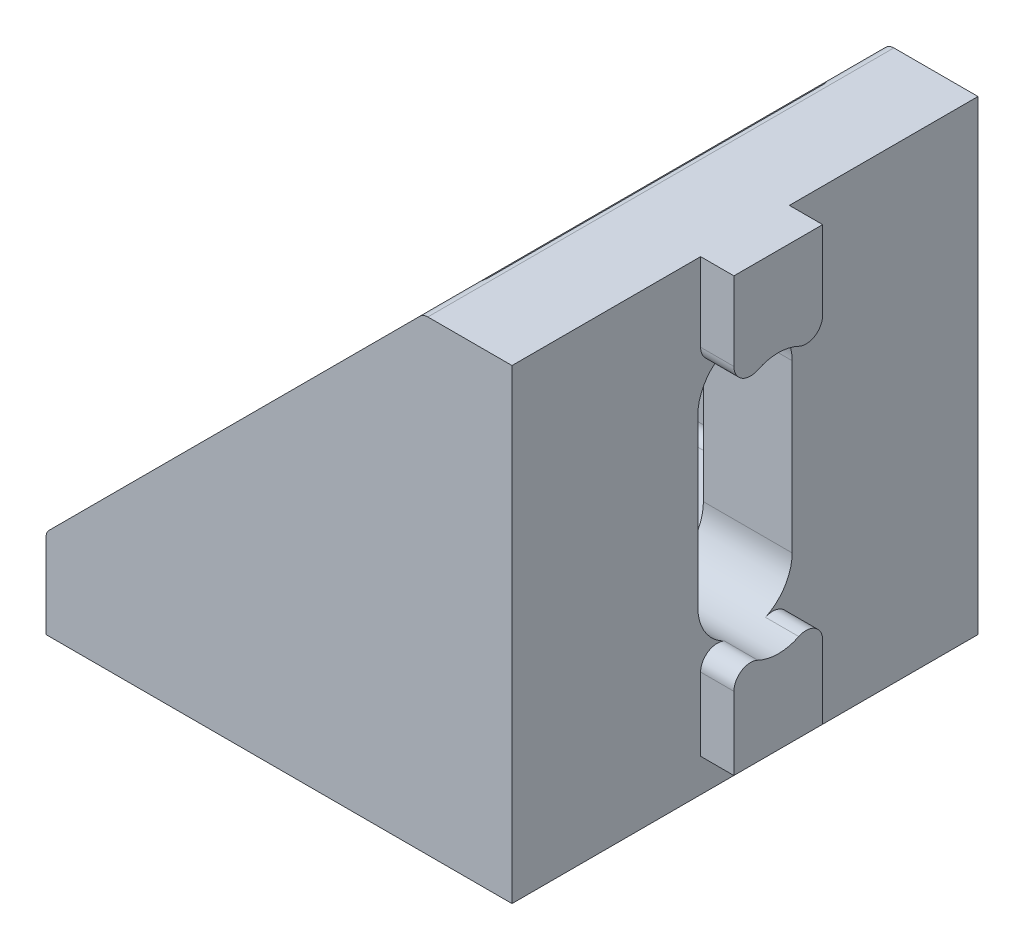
ISO-10303-21;
HEADER;
FILE_DESCRIPTION(('STEP AP214'),'2;1');
FILE_NAME('part.step','',(''),(''),'','','');
FILE_SCHEMA(('AUTOMOTIVE_DESIGN { 1 0 10303 214 1 1 1 1 }'));
ENDSEC;
DATA;
#1=APPLICATION_CONTEXT('core data for automotive mechanical design processes');
#2=APPLICATION_PROTOCOL_DEFINITION('international standard','automotive_design',2000,#1);
#3=PRODUCT_CONTEXT('',#1,'mechanical');
#4=PRODUCT('Part','Part','',(#3));
#5=PRODUCT_RELATED_PRODUCT_CATEGORY('part','',(#4));
#6=PRODUCT_DEFINITION_FORMATION('','',#4);
#7=PRODUCT_DEFINITION_CONTEXT('part definition',#1,'design');
#8=PRODUCT_DEFINITION('design','',#6,#7);
#9=PRODUCT_DEFINITION_SHAPE('','',#8);
#10=(LENGTH_UNIT() NAMED_UNIT(*) SI_UNIT(.MILLI.,.METRE.));
#11=(NAMED_UNIT(*) PLANE_ANGLE_UNIT() SI_UNIT($,.RADIAN.));
#12=(NAMED_UNIT(*) SI_UNIT($,.STERADIAN.) SOLID_ANGLE_UNIT());
#13=UNCERTAINTY_MEASURE_WITH_UNIT(LENGTH_MEASURE(1.E-05),#10,'distance_accuracy_value','');
#14=(GEOMETRIC_REPRESENTATION_CONTEXT(3) GLOBAL_UNCERTAINTY_ASSIGNED_CONTEXT((#13)) GLOBAL_UNIT_ASSIGNED_CONTEXT((#10,
#11,#12)) REPRESENTATION_CONTEXT('',''));
#15=CARTESIAN_POINT('',(0.,0.,0.));
#16=DIRECTION('',(0.,0.,1.));
#17=DIRECTION('',(1.,0.,0.));
#18=AXIS2_PLACEMENT_3D('',#15,#16,#17);
#19=CARTESIAN_POINT('',(-8.99999999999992,8.99999999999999,15.));
#20=DIRECTION('',(0.,0.,1.));
#21=DIRECTION('',(-1.,0.,0.));
#22=AXIS2_PLACEMENT_3D('',#19,#20,#21);
#23=SPHERICAL_SURFACE('',#22,1.);
#24=CARTESIAN_POINT('',(-8.99999999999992,8.99999999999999,15.));
#25=DIRECTION('',(0.,0.,-1.));
#26=DIRECTION('',(-1.,0.,0.));
#27=AXIS2_PLACEMENT_3D('',#24,#25,#26);
#28=CIRCLE('',#27,1.);
#29=CARTESIAN_POINT('',(-7.99999999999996,8.99999999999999,15.));
#30=VERTEX_POINT('',#29);
#31=CARTESIAN_POINT('',(-8.99999999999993,7.99999999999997,15.));
#32=VERTEX_POINT('',#31);
#33=EDGE_CURVE('E421',#30,#32,#28,.T.);
#34=ORIENTED_EDGE('',*,*,#33,.T.);
#35=CARTESIAN_POINT('',(-8.99999999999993,8.99999999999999,15.));
#36=DIRECTION('',(1.,0.,0.));
#37=DIRECTION('',(0.,1.,0.));
#38=AXIS2_PLACEMENT_3D('',#35,#36,#37);
#39=CIRCLE('',#38,1.);
#40=CARTESIAN_POINT('',(-8.99999999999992,8.99999999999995,16.));
#41=VERTEX_POINT('',#40);
#42=EDGE_CURVE('E304',#32,#41,#39,.F.);
#43=ORIENTED_EDGE('',*,*,#42,.T.);
#44=CARTESIAN_POINT('',(-8.99999999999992,8.99999999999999,15.));
#45=DIRECTION('',(0.,-1.,0.));
#46=DIRECTION('',(1.,0.,0.));
#47=AXIS2_PLACEMENT_3D('',#44,#45,#46);
#48=CIRCLE('',#47,1.);
#49=EDGE_CURVE('E432',#41,#30,#48,.F.);
#50=ORIENTED_EDGE('',*,*,#49,.T.);
#51=EDGE_LOOP('',(#34,#43,#50));
#52=FACE_BOUND('',#51,.T.);
#53=ADVANCED_FACE('F15',(#52),#23,.F.);
#54=CARTESIAN_POINT('',(-8.99999999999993,8.99999999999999,-15.));
#55=DIRECTION('',(0.,0.,1.));
#56=DIRECTION('',(-1.,0.,0.));
#57=AXIS2_PLACEMENT_3D('',#54,#55,#56);
#58=SPHERICAL_SURFACE('',#57,0.999999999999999);
#59=CARTESIAN_POINT('',(-8.99999999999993,8.99999999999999,-15.));
#60=DIRECTION('',(0.,-1.,0.));
#61=DIRECTION('',(1.,0.,0.));
#62=AXIS2_PLACEMENT_3D('',#59,#60,#61);
#63=CIRCLE('',#62,1.);
#64=CARTESIAN_POINT('',(-7.99999999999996,8.99999999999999,-15.));
#65=VERTEX_POINT('',#64);
#66=CARTESIAN_POINT('',(-8.99999999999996,8.99999999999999,-16.));
#67=VERTEX_POINT('',#66);
#68=EDGE_CURVE('E416',#65,#67,#63,.F.);
#69=ORIENTED_EDGE('',*,*,#68,.T.);
#70=CARTESIAN_POINT('',(-8.99999999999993,8.99999999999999,-15.));
#71=DIRECTION('',(-1.,0.,0.));
#72=DIRECTION('',(0.,-1.,0.));
#73=AXIS2_PLACEMENT_3D('',#70,#71,#72);
#74=CIRCLE('',#73,1.);
#75=CARTESIAN_POINT('',(-8.99999999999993,7.99999999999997,-15.));
#76=VERTEX_POINT('',#75);
#77=EDGE_CURVE('E442',#67,#76,#74,.T.);
#78=ORIENTED_EDGE('',*,*,#77,.T.);
#79=CARTESIAN_POINT('',(-8.99999999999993,8.99999999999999,-15.));
#80=DIRECTION('',(0.,0.,-1.));
#81=DIRECTION('',(-1.,0.,0.));
#82=AXIS2_PLACEMENT_3D('',#79,#80,#81);
#83=CIRCLE('',#82,1.);
#84=EDGE_CURVE('E425',#76,#65,#83,.F.);
#85=ORIENTED_EDGE('',*,*,#84,.T.);
#86=EDGE_LOOP('',(#69,#78,#85));
#87=FACE_BOUND('',#86,.T.);
#88=ADVANCED_FACE('F17',(#87),#58,.F.);
#89=CARTESIAN_POINT('',(-33.5,8.99999999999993,15.));
#90=DIRECTION('',(1.,0.,0.));
#91=DIRECTION('',(0.,1.,0.));
#92=AXIS2_PLACEMENT_3D('',#89,#90,#91);
#93=CYLINDRICAL_SURFACE('',#92,1.);
#94=CARTESIAN_POINT('',(-41.0000000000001,8.99999999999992,15.));
#95=DIRECTION('',(-0.707106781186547,0.707106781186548,0.));
#96=DIRECTION('',(0.707106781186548,0.707106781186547,0.));
#97=AXIS2_PLACEMENT_3D('',#94,#95,#96);
#98=ELLIPSE('',#97,1.4142135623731,1.);
#99=CARTESIAN_POINT('',(-41.0000000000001,8.99999999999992,16.));
#100=VERTEX_POINT('',#99);
#101=CARTESIAN_POINT('',(-41.7071067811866,8.29289321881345,15.7071067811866));
#102=VERTEX_POINT('',#101);
#103=EDGE_CURVE('E19',#100,#102,#98,.F.);
#104=ORIENTED_EDGE('',*,*,#103,.F.);
#105=DIRECTION('',(1.,0.,0.));
#106=VECTOR('',#105,1.);
#107=CARTESIAN_POINT('',(-42.0000000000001,8.99999999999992,16.));
#108=LINE('',#107,#106);
#109=EDGE_CURVE('E296',#100,#41,#108,.T.);
#110=ORIENTED_EDGE('',*,*,#109,.T.);
#111=ORIENTED_EDGE('',*,*,#42,.F.);
#112=DIRECTION('',(1.,0.,0.));
#113=VECTOR('',#112,1.);
#114=CARTESIAN_POINT('',(-25.,7.99999999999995,15.));
#115=LINE('',#114,#113);
#116=CARTESIAN_POINT('',(-41.9101797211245,7.99999999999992,15.));
#117=VERTEX_POINT('',#116);
#118=EDGE_CURVE('E414',#117,#32,#115,.T.);
#119=ORIENTED_EDGE('',*,*,#118,.F.);
#120=CARTESIAN_POINT('',(-41.7071067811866,8.29289321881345,15.7071067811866));
#121=CARTESIAN_POINT('',(-41.7203327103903,8.27967091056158,15.693888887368));
#122=CARTESIAN_POINT('',(-41.7328009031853,8.26645711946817,15.6799278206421));
#123=CARTESIAN_POINT('',(-41.7562441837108,8.24031039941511,15.650582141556));
#124=CARTESIAN_POINT('',(-41.7672201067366,8.22737731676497,15.6351983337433));
#125=CARTESIAN_POINT('',(-41.797806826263,8.18956620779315,15.5872297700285));
#126=CARTESIAN_POINT('',(-41.8152782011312,8.16546588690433,15.5526234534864));
#127=CARTESIAN_POINT('',(-41.8450311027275,8.12117335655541,15.479071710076));
#128=CARTESIAN_POINT('',(-41.8573175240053,8.10097747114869,15.4401304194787));
#129=CARTESIAN_POINT('',(-41.8776214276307,8.06557622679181,15.3589156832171));
#130=CARTESIAN_POINT('',(-41.8856295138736,8.05038188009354,15.3166351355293));
#131=CARTESIAN_POINT('',(-41.8982351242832,8.02552892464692,15.2291499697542));
#132=CARTESIAN_POINT('',(-41.902769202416,8.01597399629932,15.1839066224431));
#133=CARTESIAN_POINT('',(-41.9072452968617,8.00640076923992,15.1153056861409));
#134=CARTESIAN_POINT('',(-41.9083498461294,8.00400289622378,15.0923250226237));
#135=CARTESIAN_POINT('',(-41.9098150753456,8.00080243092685,15.0462326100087));
#136=CARTESIAN_POINT('',(-41.9101758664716,7.99999960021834,15.0231208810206));
#137=CARTESIAN_POINT('',(-41.9101797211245,7.99999999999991,15.));
#138=B_SPLINE_CURVE_WITH_KNOTS('',3,(#120,#121,#122,#123,#124,#125,#126,#127,#128,#129,#130,
#131,#132,#133,#134,#135,#136,#137),.UNSPECIFIED.,.F.,.F.,(4,2,2,2,2,2,2,2,4),(0.,
0.0686541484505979,0.1372697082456,0.273448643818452,0.409498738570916,0.545846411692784,
0.684628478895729,0.753966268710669,0.823293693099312),.UNSPECIFIED.);
#139=EDGE_CURVE('E299',#102,#117,#138,.T.);
#140=ORIENTED_EDGE('',*,*,#139,.F.);
#141=EDGE_LOOP('',(#104,#110,#111,#119,#140));
#142=FACE_BOUND('',#141,.T.);
#143=ADVANCED_FACE('F294',(#142),#93,.F.);
#144=CARTESIAN_POINT('',(-16.5,8.99999999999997,-15.));
#145=DIRECTION('',(-1.,0.,0.));
#146=DIRECTION('',(0.,-1.,0.));
#147=AXIS2_PLACEMENT_3D('',#144,#145,#146);
#148=CYLINDRICAL_SURFACE('',#147,1.);
#149=DIRECTION('',(1.,0.,0.));
#150=VECTOR('',#149,1.);
#151=CARTESIAN_POINT('',(-25.,7.99999999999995,-15.));
#152=LINE('',#151,#150);
#153=CARTESIAN_POINT('',(-41.9101797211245,7.99999999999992,-15.));
#154=VERTEX_POINT('',#153);
#155=EDGE_CURVE('E385',#76,#154,#152,.F.);
#156=ORIENTED_EDGE('',*,*,#155,.F.);
#157=ORIENTED_EDGE('',*,*,#77,.F.);
#158=DIRECTION('',(-1.,0.,0.));
#159=VECTOR('',#158,1.);
#160=CARTESIAN_POINT('',(-8.,8.99999999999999,-16.));
#161=LINE('',#160,#159);
#162=CARTESIAN_POINT('',(-41.0000000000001,8.99999999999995,-16.));
#163=VERTEX_POINT('',#162);
#164=EDGE_CURVE('E380',#67,#163,#161,.T.);
#165=ORIENTED_EDGE('',*,*,#164,.T.);
#166=CARTESIAN_POINT('',(-41.0000000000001,8.99999999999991,-15.));
#167=DIRECTION('',(-0.707106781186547,0.707106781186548,0.));
#168=DIRECTION('',(-0.707106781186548,-0.707106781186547,0.));
#169=AXIS2_PLACEMENT_3D('',#166,#167,#168);
#170=ELLIPSE('',#169,1.4142135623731,1.);
#171=CARTESIAN_POINT('',(-41.7071067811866,8.29289321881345,-15.7071067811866));
#172=VERTEX_POINT('',#171);
#173=EDGE_CURVE('E447',#172,#163,#170,.F.);
#174=ORIENTED_EDGE('',*,*,#173,.F.);
#175=CARTESIAN_POINT('',(-41.9101797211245,7.99999999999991,-15.));
#176=CARTESIAN_POINT('',(-41.9101746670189,7.99999953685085,-15.0246340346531));
#177=CARTESIAN_POINT('',(-41.9097657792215,8.00091101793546,-15.0492570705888));
#178=CARTESIAN_POINT('',(-41.9081017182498,8.00454300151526,-15.0983448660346));
#179=CARTESIAN_POINT('',(-41.90684639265,8.00726382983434,-15.122809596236));
#180=CARTESIAN_POINT('',(-41.9017478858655,8.01812847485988,-15.1958220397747));
#181=CARTESIAN_POINT('',(-41.8965719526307,8.02897437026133,-15.2439126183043));
#182=CARTESIAN_POINT('',(-41.8819457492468,8.05740710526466,-15.3375202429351));
#183=CARTESIAN_POINT('',(-41.8724834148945,8.07501294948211,-15.3830296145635));
#184=CARTESIAN_POINT('',(-41.8482488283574,8.11591294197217,-15.4697604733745));
#185=CARTESIAN_POINT('',(-41.83349306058,8.13918935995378,-15.5109947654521));
#186=CARTESIAN_POINT('',(-41.8015813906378,8.18415631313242,-15.5793863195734));
#187=CARTESIAN_POINT('',(-41.7856730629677,8.20506393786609,-15.6076423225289));
#188=CARTESIAN_POINT('',(-41.7586524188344,8.23743495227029,-15.6471379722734));
#189=CARTESIAN_POINT('',(-41.7490900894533,8.24842353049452,-15.659851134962));
#190=CARTESIAN_POINT('',(-41.7289001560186,8.27057089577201,-15.6842554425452));
#191=CARTESIAN_POINT('',(-41.7182720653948,8.28172975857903,-15.6959461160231));
#192=CARTESIAN_POINT('',(-41.7071067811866,8.29289321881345,-15.7071067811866));
#193=B_SPLINE_CURVE_WITH_KNOTS('',3,(#175,#176,#177,#178,#179,#180,#181,#182,#183,#184,#185,
#186,#187,#188,#189,#190,#191,#192),.UNSPECIFIED.,.F.,.F.,(4,2,2,2,2,2,2,2,4),(0.,
0.0738596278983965,0.147732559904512,0.295701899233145,0.44409031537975,0.592020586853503,
0.707317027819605,0.765268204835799,0.823245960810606),.UNSPECIFIED.);
#194=EDGE_CURVE('E446',#154,#172,#193,.T.);
#195=ORIENTED_EDGE('',*,*,#194,.F.);
#196=EDGE_LOOP('',(#156,#157,#165,#174,#195));
#197=FACE_BOUND('',#196,.T.);
#198=ADVANCED_FACE('F611',(#197),#148,.F.);
#199=CARTESIAN_POINT('',(-8.99999999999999,42.,15.));
#200=DIRECTION('',(0.,-1.,0.));
#201=DIRECTION('',(1.,0.,0.));
#202=AXIS2_PLACEMENT_3D('',#199,#200,#201);
#203=CYLINDRICAL_SURFACE('',#202,1.);
#204=DIRECTION('',(0.,1.,0.));
#205=VECTOR('',#204,1.);
#206=CARTESIAN_POINT('',(-7.99999999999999,42.,15.));
#207=LINE('',#206,#205);
#208=CARTESIAN_POINT('',(-8.,41.9101797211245,15.));
#209=VERTEX_POINT('',#208);
#210=EDGE_CURVE('E360',#209,#30,#207,.F.);
#211=ORIENTED_EDGE('',*,*,#210,.T.);
#212=ORIENTED_EDGE('',*,*,#49,.F.);
#213=DIRECTION('',(0.,1.,0.));
#214=VECTOR('',#213,1.);
#215=CARTESIAN_POINT('',(-8.99999999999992,41.9999999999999,16.));
#216=LINE('',#215,#214);
#217=CARTESIAN_POINT('',(-8.99999999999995,41.,16.));
#218=VERTEX_POINT('',#217);
#219=EDGE_CURVE('E311',#41,#218,#216,.T.);
#220=ORIENTED_EDGE('',*,*,#219,.T.);
#221=CARTESIAN_POINT('',(-8.99999999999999,41.,15.));
#222=DIRECTION('',(-0.707106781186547,0.707106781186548,0.));
#223=DIRECTION('',(-0.707106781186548,-0.707106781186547,0.));
#224=AXIS2_PLACEMENT_3D('',#221,#222,#223);
#225=ELLIPSE('',#224,1.41421356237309,1.);
#226=CARTESIAN_POINT('',(-8.29289321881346,41.7071067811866,15.7071067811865));
#227=VERTEX_POINT('',#226);
#228=EDGE_CURVE('E318',#227,#218,#225,.F.);
#229=ORIENTED_EDGE('',*,*,#228,.F.);
#230=CARTESIAN_POINT('',(-7.99999999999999,41.9101797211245,15.));
#231=CARTESIAN_POINT('',(-7.99999953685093,41.9101746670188,15.024634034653));
#232=CARTESIAN_POINT('',(-8.00091101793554,41.9097657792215,15.0492570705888));
#233=CARTESIAN_POINT('',(-8.00454300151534,41.9081017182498,15.0983448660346));
#234=CARTESIAN_POINT('',(-8.00726382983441,41.9068463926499,15.122809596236));
#235=CARTESIAN_POINT('',(-8.01812847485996,41.9017478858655,15.1958220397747));
#236=CARTESIAN_POINT('',(-8.02897437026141,41.8965719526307,15.2439126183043));
#237=CARTESIAN_POINT('',(-8.05740710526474,41.8819457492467,15.3375202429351));
#238=CARTESIAN_POINT('',(-8.07501294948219,41.8724834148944,15.3830296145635));
#239=CARTESIAN_POINT('',(-8.11591294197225,41.8482488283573,15.4697604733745));
#240=CARTESIAN_POINT('',(-8.13918935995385,41.83349306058,15.510994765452));
#241=CARTESIAN_POINT('',(-8.18415631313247,41.8015813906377,15.5793863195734));
#242=CARTESIAN_POINT('',(-8.20506393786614,41.7856730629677,15.6076423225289));
#243=CARTESIAN_POINT('',(-8.23743495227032,41.7586524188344,15.6471379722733));
#244=CARTESIAN_POINT('',(-8.24842353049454,41.7490900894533,15.6598511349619));
#245=CARTESIAN_POINT('',(-8.27057089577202,41.7289001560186,15.6842554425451));
#246=CARTESIAN_POINT('',(-8.28172975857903,41.7182720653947,15.695946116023));
#247=CARTESIAN_POINT('',(-8.29289321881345,41.7071067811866,15.7071067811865));
#248=B_SPLINE_CURVE_WITH_KNOTS('',3,(#230,#231,#232,#233,#234,#235,#236,#237,#238,#239,#240,
#241,#242,#243,#244,#245,#246,#247),.UNSPECIFIED.,.F.,.F.,(4,2,2,2,2,2,2,2,4),(0.,
0.0738596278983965,0.147732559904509,0.295701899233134,0.444090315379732,0.592020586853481,
0.707317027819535,0.765268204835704,0.823245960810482),.UNSPECIFIED.);
#249=EDGE_CURVE('E429',#209,#227,#248,.T.);
#250=ORIENTED_EDGE('',*,*,#249,.F.);
#251=EDGE_LOOP('',(#211,#212,#220,#229,#250));
#252=FACE_BOUND('',#251,.T.);
#253=ADVANCED_FACE('F606',(#252),#203,.F.);
#254=CARTESIAN_POINT('',(-8.99999999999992,8.99999999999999,7.99999999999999));
#255=DIRECTION('',(0.,0.,-1.));
#256=DIRECTION('',(-1.,0.,0.));
#257=AXIS2_PLACEMENT_3D('',#254,#255,#256);
#258=CYLINDRICAL_SURFACE('',#257,1.);
#259=DIRECTION('',(0.,0.,-1.));
#260=VECTOR('',#259,1.);
#261=CARTESIAN_POINT('',(-7.99999999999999,8.99999999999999,16.));
#262=LINE('',#261,#260);
#263=EDGE_CURVE('E331',#30,#65,#262,.T.);
#264=ORIENTED_EDGE('',*,*,#263,.T.);
#265=ORIENTED_EDGE('',*,*,#84,.F.);
#266=DIRECTION('',(0.,0.,1.));
#267=VECTOR('',#266,1.);
#268=CARTESIAN_POINT('',(-8.99999999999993,7.99999999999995,0.));
#269=LINE('',#268,#267);
#270=EDGE_CURVE('E438',#32,#76,#269,.F.);
#271=ORIENTED_EDGE('',*,*,#270,.F.);
#272=ORIENTED_EDGE('',*,*,#33,.F.);
#273=EDGE_LOOP('',(#264,#265,#271,#272));
#274=FACE_BOUND('',#273,.T.);
#275=ADVANCED_FACE('F610',(#274),#258,.F.);
#276=CARTESIAN_POINT('',(-9.,42.,-15.));
#277=DIRECTION('',(0.,-1.,0.));
#278=DIRECTION('',(1.,0.,0.));
#279=AXIS2_PLACEMENT_3D('',#276,#277,#278);
#280=CYLINDRICAL_SURFACE('',#279,1.);
#281=CARTESIAN_POINT('',(-9.,41.,-15.));
#282=DIRECTION('',(-0.707106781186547,0.707106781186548,0.));
#283=DIRECTION('',(-0.707106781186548,-0.707106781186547,0.));
#284=AXIS2_PLACEMENT_3D('',#281,#282,#283);
#285=ELLIPSE('',#284,1.41421356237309,1.);
#286=CARTESIAN_POINT('',(-9.,41.,-16.));
#287=VERTEX_POINT('',#286);
#288=CARTESIAN_POINT('',(-8.29289321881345,41.7071067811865,-15.7071067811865));
#289=VERTEX_POINT('',#288);
#290=EDGE_CURVE('E420',#287,#289,#285,.F.);
#291=ORIENTED_EDGE('',*,*,#290,.F.);
#292=DIRECTION('',(0.,1.,0.));
#293=VECTOR('',#292,1.);
#294=CARTESIAN_POINT('',(-9.,42.,-16.));
#295=LINE('',#294,#293);
#296=EDGE_CURVE('E384',#287,#67,#295,.F.);
#297=ORIENTED_EDGE('',*,*,#296,.T.);
#298=ORIENTED_EDGE('',*,*,#68,.F.);
#299=DIRECTION('',(0.,1.,0.));
#300=VECTOR('',#299,1.);
#301=CARTESIAN_POINT('',(-7.99999999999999,42.,-15.));
#302=LINE('',#301,#300);
#303=CARTESIAN_POINT('',(-8.,41.9101797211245,-15.));
#304=VERTEX_POINT('',#303);
#305=EDGE_CURVE('E321',#65,#304,#302,.T.);
#306=ORIENTED_EDGE('',*,*,#305,.T.);
#307=CARTESIAN_POINT('',(-8.29289321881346,41.7071067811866,-15.7071067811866));
#308=CARTESIAN_POINT('',(-8.27967091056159,41.7203327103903,-15.6938888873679));
#309=CARTESIAN_POINT('',(-8.26645711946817,41.7328009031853,-15.6799278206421));
#310=CARTESIAN_POINT('',(-8.24031039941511,41.7562441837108,-15.6505821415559));
#311=CARTESIAN_POINT('',(-8.22737731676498,41.7672201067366,-15.6351983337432));
#312=CARTESIAN_POINT('',(-8.18956620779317,41.797806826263,-15.5872297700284));
#313=CARTESIAN_POINT('',(-8.16546588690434,41.8152782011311,-15.5526234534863));
#314=CARTESIAN_POINT('',(-8.12117335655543,41.8450311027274,-15.4790717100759));
#315=CARTESIAN_POINT('',(-8.10097747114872,41.8573175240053,-15.4401304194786));
#316=CARTESIAN_POINT('',(-8.06557622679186,41.8776214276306,-15.358915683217));
#317=CARTESIAN_POINT('',(-8.05038188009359,41.8856295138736,-15.3166351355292));
#318=CARTESIAN_POINT('',(-8.02552892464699,41.8982351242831,-15.2291499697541));
#319=CARTESIAN_POINT('',(-8.0159739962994,41.902769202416,-15.183906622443));
#320=CARTESIAN_POINT('',(-8.00640076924,41.9072452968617,-15.1153056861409));
#321=CARTESIAN_POINT('',(-8.00400289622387,41.9083498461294,-15.0923250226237));
#322=CARTESIAN_POINT('',(-8.00080243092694,41.9098150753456,-15.0462326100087));
#323=CARTESIAN_POINT('',(-7.99999960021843,41.9101758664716,-15.0231208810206));
#324=CARTESIAN_POINT('',(-8.,41.9101797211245,-15.));
#325=B_SPLINE_CURVE_WITH_KNOTS('',3,(#307,#308,#309,#310,#311,#312,#313,#314,#315,#316,#317,
#318,#319,#320,#321,#322,#323,#324),.UNSPECIFIED.,.F.,.F.,(4,2,2,2,2,2,2,2,4),(0.,
0.0686541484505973,0.1372697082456,0.273448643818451,0.409498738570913,0.545846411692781,
0.684628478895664,0.753966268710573,0.823293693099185),.UNSPECIFIED.);
#326=EDGE_CURVE('E313',#289,#304,#325,.T.);
#327=ORIENTED_EDGE('',*,*,#326,.F.);
#328=EDGE_LOOP('',(#291,#297,#298,#306,#327));
#329=FACE_BOUND('',#328,.T.);
#330=ADVANCED_FACE('F584',(#329),#280,.F.);
#331=CARTESIAN_POINT('',(-42.0000000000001,41.9999999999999,16.));
#332=DIRECTION('',(0.,0.,1.));
#333=DIRECTION('',(1.,0.,0.));
#334=AXIS2_PLACEMENT_3D('',#331,#332,#333);
#335=PLANE('',#334);
#336=ORIENTED_EDGE('',*,*,#109,.F.);
#337=DIRECTION('',(-0.707106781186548,-0.707106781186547,0.));
#338=VECTOR('',#337,1.);
#339=CARTESIAN_POINT('',(-42.,8.,16.));
#340=LINE('',#339,#338);
#341=EDGE_CURVE('E309',#218,#100,#340,.T.);
#342=ORIENTED_EDGE('',*,*,#341,.F.);
#343=ORIENTED_EDGE('',*,*,#219,.F.);
#344=EDGE_LOOP('',(#336,#342,#343));
#345=FACE_BOUND('',#344,.T.);
#346=ADVANCED_FACE('F308',(#345),#335,.F.);
#347=CARTESIAN_POINT('',(-42.,-3.,-4.));
#348=DIRECTION('',(0.,-1.,0.));
#349=DIRECTION('',(0.,0.,-1.));
#350=AXIS2_PLACEMENT_3D('',#347,#348,#349);
#351=PLANE('',#350);
#352=CARTESIAN_POINT('',(-9.57192120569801,-2.99999999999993,2.49999999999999));
#353=DIRECTION('',(0.,-1.,0.));
#354=DIRECTION('',(1.,0.,0.));
#355=AXIS2_PLACEMENT_3D('',#352,#353,#354);
#356=CIRCLE('',#355,1.5);
#357=CARTESIAN_POINT('',(-10.922724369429,-2.99999999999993,1.84782608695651));
#358=VERTEX_POINT('',#357);
#359=CARTESIAN_POINT('',(-9.57192120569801,-2.99999999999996,4.));
#360=VERTEX_POINT('',#359);
#361=EDGE_CURVE('E327',#358,#360,#356,.F.);
#362=ORIENTED_EDGE('',*,*,#361,.F.);
#363=CARTESIAN_POINT('',(-14.75,-2.99999999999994,0.));
#364=DIRECTION('',(0.,-1.,0.));
#365=DIRECTION('',(1.,0.,0.));
#366=AXIS2_PLACEMENT_3D('',#363,#364,#365);
#367=CIRCLE('',#366,4.25);
#368=CARTESIAN_POINT('',(-10.922724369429,-2.99999999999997,-1.84782608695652));
#369=VERTEX_POINT('',#368);
#370=EDGE_CURVE('E564',#358,#369,#367,.F.);
#371=ORIENTED_EDGE('',*,*,#370,.T.);
#372=CARTESIAN_POINT('',(-9.571921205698,-3.,-2.5));
#373=DIRECTION('',(0.,1.,0.));
#374=DIRECTION('',(-1.,0.,0.));
#375=AXIS2_PLACEMENT_3D('',#372,#373,#374);
#376=CIRCLE('',#375,1.5);
#377=CARTESIAN_POINT('',(-9.571921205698,-3.,-4.));
#378=VERTEX_POINT('',#377);
#379=EDGE_CURVE('E402',#378,#369,#376,.T.);
#380=ORIENTED_EDGE('',*,*,#379,.F.);
#381=DIRECTION('',(-1.,0.,0.));
#382=VECTOR('',#381,1.);
#383=CARTESIAN_POINT('',(-42.,-3.,-4.));
#384=LINE('',#383,#382);
#385=CARTESIAN_POINT('',(-3.00000000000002,-3.,-4.));
#386=VERTEX_POINT('',#385);
#387=EDGE_CURVE('E398',#386,#378,#384,.T.);
#388=ORIENTED_EDGE('',*,*,#387,.F.);
#389=DIRECTION('',(0.,0.,-1.));
#390=VECTOR('',#389,1.);
#391=CARTESIAN_POINT('',(-3.00000000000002,-3.,0.));
#392=LINE('',#391,#390);
#393=CARTESIAN_POINT('',(-3.00000000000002,-3.,4.));
#394=VERTEX_POINT('',#393);
#395=EDGE_CURVE('E404',#394,#386,#392,.T.);
#396=ORIENTED_EDGE('',*,*,#395,.F.);
#397=DIRECTION('',(1.,0.,0.));
#398=VECTOR('',#397,1.);
#399=CARTESIAN_POINT('',(-42.,-3.,4.));
#400=LINE('',#399,#398);
#401=EDGE_CURVE('E409',#360,#394,#400,.T.);
#402=ORIENTED_EDGE('',*,*,#401,.F.);
#403=EDGE_LOOP('',(#362,#371,#380,#388,#396,#402));
#404=FACE_BOUND('',#403,.T.);
#405=ADVANCED_FACE('F716',(#404),#351,.T.);
#406=CARTESIAN_POINT('',(-25.,7.99999999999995,0.));
#407=DIRECTION('',(0.,1.,0.));
#408=DIRECTION('',(0.,0.,1.));
#409=AXIS2_PLACEMENT_3D('',#406,#407,#408);
#410=PLANE('',#409);
#411=DIRECTION('',(-1.,0.,0.));
#412=VECTOR('',#411,1.);
#413=CARTESIAN_POINT('',(-14.75,7.99999999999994,-4.25000000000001));
#414=LINE('',#413,#412);
#415=CARTESIAN_POINT('',(-29.75,7.99999999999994,-4.25000000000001));
#416=VERTEX_POINT('',#415);
#417=CARTESIAN_POINT('',(-14.75,7.99999999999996,-4.25000000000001));
#418=VERTEX_POINT('',#417);
#419=EDGE_CURVE('E394',#416,#418,#414,.F.);
#420=ORIENTED_EDGE('',*,*,#419,.T.);
#421=CARTESIAN_POINT('',(-14.75,7.99999999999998,0.));
#422=DIRECTION('',(0.,-1.,0.));
#423=DIRECTION('',(1.,0.,0.));
#424=AXIS2_PLACEMENT_3D('',#421,#422,#423);
#425=CIRCLE('',#424,4.25);
#426=CARTESIAN_POINT('',(-14.75,7.99999999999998,4.24999999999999));
#427=VERTEX_POINT('',#426);
#428=EDGE_CURVE('E567',#418,#427,#425,.T.);
#429=ORIENTED_EDGE('',*,*,#428,.T.);
#430=DIRECTION('',(1.,0.,0.));
#431=VECTOR('',#430,1.);
#432=CARTESIAN_POINT('',(-29.75,7.99999999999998,4.24999999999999));
#433=LINE('',#432,#431);
#434=CARTESIAN_POINT('',(-29.75,7.99999999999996,4.24999999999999));
#435=VERTEX_POINT('',#434);
#436=EDGE_CURVE('E390',#427,#435,#433,.F.);
#437=ORIENTED_EDGE('',*,*,#436,.T.);
#438=CARTESIAN_POINT('',(-29.75,7.99999999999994,0.));
#439=DIRECTION('',(0.,-1.,0.));
#440=DIRECTION('',(1.,0.,0.));
#441=AXIS2_PLACEMENT_3D('',#438,#439,#440);
#442=CIRCLE('',#441,4.25);
#443=EDGE_CURVE('E553',#435,#416,#442,.T.);
#444=ORIENTED_EDGE('',*,*,#443,.T.);
#445=EDGE_LOOP('',(#420,#429,#437,#444));
#446=FACE_BOUND('',#445,.T.);
#447=ORIENTED_EDGE('',*,*,#270,.T.);
#448=ORIENTED_EDGE('',*,*,#155,.T.);
#449=DIRECTION('',(0.,0.,-1.));
#450=VECTOR('',#449,1.);
#451=CARTESIAN_POINT('',(-41.9101797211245,7.99999999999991,0.));
#452=LINE('',#451,#450);
#453=EDGE_CURVE('E363',#117,#154,#452,.T.);
#454=ORIENTED_EDGE('',*,*,#453,.F.);
#455=ORIENTED_EDGE('',*,*,#118,.T.);
#456=EDGE_LOOP('',(#447,#448,#454,#455));
#457=FACE_BOUND('',#456,.T.);
#458=ADVANCED_FACE('F753',(#446,#457),#410,.T.);
#459=CARTESIAN_POINT('',(-8.,42.,-16.));
#460=DIRECTION('',(0.,0.,-1.));
#461=DIRECTION('',(-1.,0.,0.));
#462=AXIS2_PLACEMENT_3D('',#459,#460,#461);
#463=PLANE('',#462);
#464=DIRECTION('',(-0.707106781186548,-0.707106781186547,0.));
#465=VECTOR('',#464,1.);
#466=CARTESIAN_POINT('',(-42.,8.,-16.));
#467=LINE('',#466,#465);
#468=EDGE_CURVE('E650',#163,#287,#467,.F.);
#469=ORIENTED_EDGE('',*,*,#468,.F.);
#470=ORIENTED_EDGE('',*,*,#164,.F.);
#471=ORIENTED_EDGE('',*,*,#296,.F.);
#472=EDGE_LOOP('',(#469,#470,#471));
#473=FACE_BOUND('',#472,.T.);
#474=ADVANCED_FACE('F630',(#473),#463,.F.);
#475=CARTESIAN_POINT('',(-41.,7.5857864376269,0.));
#476=DIRECTION('',(0.,0.,-1.));
#477=DIRECTION('',(-1.,0.,0.));
#478=AXIS2_PLACEMENT_3D('',#475,#476,#477);
#479=CYLINDRICAL_SURFACE('',#478,1.);
#480=ORIENTED_EDGE('',*,*,#194,.T.);
#481=DIRECTION('',(0.,0.,1.));
#482=VECTOR('',#481,1.);
#483=CARTESIAN_POINT('',(-41.7071067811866,8.29289321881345,0.));
#484=LINE('',#483,#482);
#485=CARTESIAN_POINT('',(-41.7071067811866,8.29289321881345,-21.));
#486=VERTEX_POINT('',#485);
#487=EDGE_CURVE('E653',#486,#172,#484,.T.);
#488=ORIENTED_EDGE('',*,*,#487,.F.);
#489=CARTESIAN_POINT('',(-41.,7.5857864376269,-21.));
#490=DIRECTION('',(0.,0.,-1.));
#491=DIRECTION('',(-1.,0.,0.));
#492=AXIS2_PLACEMENT_3D('',#489,#490,#491);
#493=CIRCLE('',#492,1.);
#494=CARTESIAN_POINT('',(-42.,7.5857864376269,-21.));
#495=VERTEX_POINT('',#494);
#496=EDGE_CURVE('E389',#486,#495,#493,.F.);
#497=ORIENTED_EDGE('',*,*,#496,.T.);
#498=DIRECTION('',(0.,0.,1.));
#499=VECTOR('',#498,1.);
#500=CARTESIAN_POINT('',(-42.,7.5857864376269,0.));
#501=LINE('',#500,#499);
#502=CARTESIAN_POINT('',(-42.,7.5857864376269,21.));
#503=VERTEX_POINT('',#502);
#504=EDGE_CURVE('E660',#503,#495,#501,.F.);
#505=ORIENTED_EDGE('',*,*,#504,.F.);
#506=CARTESIAN_POINT('',(-41.,7.5857864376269,21.));
#507=DIRECTION('',(0.,0.,-1.));
#508=DIRECTION('',(-1.,0.,0.));
#509=AXIS2_PLACEMENT_3D('',#506,#507,#508);
#510=CIRCLE('',#509,1.);
#511=CARTESIAN_POINT('',(-41.7071067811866,8.29289321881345,21.));
#512=VERTEX_POINT('',#511);
#513=EDGE_CURVE('E379',#503,#512,#510,.T.);
#514=ORIENTED_EDGE('',*,*,#513,.T.);
#515=DIRECTION('',(0.,0.,1.));
#516=VECTOR('',#515,1.);
#517=CARTESIAN_POINT('',(-41.7071067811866,8.29289321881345,0.));
#518=LINE('',#517,#516);
#519=EDGE_CURVE('E320',#102,#512,#518,.T.);
#520=ORIENTED_EDGE('',*,*,#519,.F.);
#521=ORIENTED_EDGE('',*,*,#139,.T.);
#522=ORIENTED_EDGE('',*,*,#453,.T.);
#523=EDGE_LOOP('',(#480,#488,#497,#505,#514,#520,#521,#522));
#524=FACE_BOUND('',#523,.T.);
#525=ADVANCED_FACE('F624',(#524),#479,.T.);
#526=CARTESIAN_POINT('',(-42.,-3.,-4.));
#527=DIRECTION('',(0.,-1.,0.));
#528=DIRECTION('',(0.,0.,-1.));
#529=AXIS2_PLACEMENT_3D('',#526,#527,#528);
#530=PLANE('',#529);
#531=DIRECTION('',(0.,0.,1.));
#532=VECTOR('',#531,1.);
#533=CARTESIAN_POINT('',(-42.,-3.,0.));
#534=LINE('',#533,#532);
#535=CARTESIAN_POINT('',(-42.,-3.,-4.));
#536=VERTEX_POINT('',#535);
#537=CARTESIAN_POINT('',(-42.,-3.,4.));
#538=VERTEX_POINT('',#537);
#539=EDGE_CURVE('E369',#536,#538,#534,.T.);
#540=ORIENTED_EDGE('',*,*,#539,.F.);
#541=DIRECTION('',(-1.,0.,0.));
#542=VECTOR('',#541,1.);
#543=CARTESIAN_POINT('',(-42.,-3.,-4.));
#544=LINE('',#543,#542);
#545=CARTESIAN_POINT('',(-34.928078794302,-2.99999999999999,-4.));
#546=VERTEX_POINT('',#545);
#547=EDGE_CURVE('E368',#546,#536,#544,.T.);
#548=ORIENTED_EDGE('',*,*,#547,.F.);
#549=CARTESIAN_POINT('',(-34.928078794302,-2.99999999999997,-2.5));
#550=DIRECTION('',(0.,-1.,0.));
#551=DIRECTION('',(1.,0.,0.));
#552=AXIS2_PLACEMENT_3D('',#549,#550,#551);
#553=CIRCLE('',#552,1.5);
#554=CARTESIAN_POINT('',(-33.577275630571,-2.99999999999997,-1.84782608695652));
#555=VERTEX_POINT('',#554);
#556=EDGE_CURVE('E562',#555,#546,#553,.F.);
#557=ORIENTED_EDGE('',*,*,#556,.F.);
#558=CARTESIAN_POINT('',(-29.75,-2.99999999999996,0.));
#559=DIRECTION('',(0.,-1.,0.));
#560=DIRECTION('',(1.,0.,0.));
#561=AXIS2_PLACEMENT_3D('',#558,#559,#560);
#562=CIRCLE('',#561,4.25);
#563=CARTESIAN_POINT('',(-33.577275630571,-2.99999999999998,1.84782608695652));
#564=VERTEX_POINT('',#563);
#565=EDGE_CURVE('E557',#555,#564,#562,.F.);
#566=ORIENTED_EDGE('',*,*,#565,.T.);
#567=CARTESIAN_POINT('',(-34.928078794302,-3.,2.49999999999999));
#568=DIRECTION('',(0.,1.,0.));
#569=DIRECTION('',(-1.,0.,0.));
#570=AXIS2_PLACEMENT_3D('',#567,#568,#569);
#571=CIRCLE('',#570,1.5);
#572=CARTESIAN_POINT('',(-34.928078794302,-3.,4.));
#573=VERTEX_POINT('',#572);
#574=EDGE_CURVE('E367',#573,#564,#571,.T.);
#575=ORIENTED_EDGE('',*,*,#574,.F.);
#576=DIRECTION('',(1.,0.,0.));
#577=VECTOR('',#576,1.);
#578=CARTESIAN_POINT('',(-42.,-3.,4.));
#579=LINE('',#578,#577);
#580=EDGE_CURVE('E364',#538,#573,#579,.T.);
#581=ORIENTED_EDGE('',*,*,#580,.F.);
#582=EDGE_LOOP('',(#540,#548,#557,#566,#575,#581));
#583=FACE_BOUND('',#582,.T.);
#584=ADVANCED_FACE('F629',(#583),#530,.T.);
#585=CARTESIAN_POINT('',(3.,42.,4.));
#586=DIRECTION('',(1.,0.,0.));
#587=DIRECTION('',(0.,0.,-1.));
#588=AXIS2_PLACEMENT_3D('',#585,#586,#587);
#589=PLANE('',#588);
#590=CARTESIAN_POINT('',(3.00000000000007,9.57192120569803,-2.5));
#591=DIRECTION('',(1.,0.,0.));
#592=DIRECTION('',(0.,1.,0.));
#593=AXIS2_PLACEMENT_3D('',#590,#591,#592);
#594=CIRCLE('',#593,1.5);
#595=CARTESIAN_POINT('',(3.00000000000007,10.922724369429,-1.84782608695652));
#596=VERTEX_POINT('',#595);
#597=CARTESIAN_POINT('',(3.00000000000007,9.57192120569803,-4.));
#598=VERTEX_POINT('',#597);
#599=EDGE_CURVE('E343',#596,#598,#594,.F.);
#600=ORIENTED_EDGE('',*,*,#599,.F.);
#601=CARTESIAN_POINT('',(3.00000000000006,14.75,0.));
#602=DIRECTION('',(1.,0.,0.));
#603=DIRECTION('',(0.,1.,0.));
#604=AXIS2_PLACEMENT_3D('',#601,#602,#603);
#605=CIRCLE('',#604,4.25);
#606=CARTESIAN_POINT('',(3.00000000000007,10.922724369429,1.84782608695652));
#607=VERTEX_POINT('',#606);
#608=EDGE_CURVE('E542',#596,#607,#605,.F.);
#609=ORIENTED_EDGE('',*,*,#608,.T.);
#610=CARTESIAN_POINT('',(3.00000000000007,9.57192120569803,2.5));
#611=DIRECTION('',(-1.,0.,0.));
#612=DIRECTION('',(0.,-1.,0.));
#613=AXIS2_PLACEMENT_3D('',#610,#611,#612);
#614=CIRCLE('',#613,1.5);
#615=CARTESIAN_POINT('',(3.00000000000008,9.57192120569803,4.));
#616=VERTEX_POINT('',#615);
#617=EDGE_CURVE('E349',#616,#607,#614,.T.);
#618=ORIENTED_EDGE('',*,*,#617,.F.);
#619=DIRECTION('',(0.,1.,0.));
#620=VECTOR('',#619,1.);
#621=CARTESIAN_POINT('',(3.00000000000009,42.,4.));
#622=LINE('',#621,#620);
#623=CARTESIAN_POINT('',(3.00000000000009,3.00000000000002,4.));
#624=VERTEX_POINT('',#623);
#625=EDGE_CURVE('E345',#624,#616,#622,.T.);
#626=ORIENTED_EDGE('',*,*,#625,.F.);
#627=DIRECTION('',(0.,0.,1.));
#628=VECTOR('',#627,1.);
#629=CARTESIAN_POINT('',(3.00000000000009,3.00000000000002,0.));
#630=LINE('',#629,#628);
#631=CARTESIAN_POINT('',(3.00000000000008,3.00000000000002,-4.));
#632=VERTEX_POINT('',#631);
#633=EDGE_CURVE('E351',#624,#632,#630,.F.);
#634=ORIENTED_EDGE('',*,*,#633,.T.);
#635=DIRECTION('',(0.,1.,0.));
#636=VECTOR('',#635,1.);
#637=CARTESIAN_POINT('',(3.00000000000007,42.,-4.));
#638=LINE('',#637,#636);
#639=EDGE_CURVE('E356',#598,#632,#638,.F.);
#640=ORIENTED_EDGE('',*,*,#639,.F.);
#641=EDGE_LOOP('',(#600,#609,#618,#626,#634,#640));
#642=FACE_BOUND('',#641,.T.);
#643=ADVANCED_FACE('F1045',(#642),#589,.T.);
#644=CARTESIAN_POINT('',(-7.99999999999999,42.,16.));
#645=DIRECTION('',(1.,0.,0.));
#646=DIRECTION('',(0.,0.,-1.));
#647=AXIS2_PLACEMENT_3D('',#644,#645,#646);
#648=PLANE('',#647);
#649=CARTESIAN_POINT('',(-7.99999999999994,14.75,0.));
#650=DIRECTION('',(1.,0.,0.));
#651=DIRECTION('',(0.,1.,0.));
#652=AXIS2_PLACEMENT_3D('',#649,#650,#651);
#653=CIRCLE('',#652,4.25);
#654=CARTESIAN_POINT('',(-7.99999999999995,14.75,4.25000000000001));
#655=VERTEX_POINT('',#654);
#656=CARTESIAN_POINT('',(-7.99999999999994,14.75,-4.25));
#657=VERTEX_POINT('',#656);
#658=EDGE_CURVE('E545',#655,#657,#653,.T.);
#659=ORIENTED_EDGE('',*,*,#658,.T.);
#660=DIRECTION('',(0.,1.,0.));
#661=VECTOR('',#660,1.);
#662=CARTESIAN_POINT('',(-7.99999999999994,29.75,-4.25));
#663=LINE('',#662,#661);
#664=CARTESIAN_POINT('',(-7.99999999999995,29.75,-4.25));
#665=VERTEX_POINT('',#664);
#666=EDGE_CURVE('E340',#657,#665,#663,.T.);
#667=ORIENTED_EDGE('',*,*,#666,.T.);
#668=CARTESIAN_POINT('',(-7.99999999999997,29.75,0.));
#669=DIRECTION('',(1.,0.,0.));
#670=DIRECTION('',(0.,1.,0.));
#671=AXIS2_PLACEMENT_3D('',#668,#669,#670);
#672=CIRCLE('',#671,4.25);
#673=CARTESIAN_POINT('',(-7.99999999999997,29.75,4.25000000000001));
#674=VERTEX_POINT('',#673);
#675=EDGE_CURVE('E536',#665,#674,#672,.T.);
#676=ORIENTED_EDGE('',*,*,#675,.T.);
#677=DIRECTION('',(0.,1.,0.));
#678=VECTOR('',#677,1.);
#679=CARTESIAN_POINT('',(-7.99999999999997,14.75,4.25000000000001));
#680=LINE('',#679,#678);
#681=EDGE_CURVE('E335',#674,#655,#680,.F.);
#682=ORIENTED_EDGE('',*,*,#681,.T.);
#683=EDGE_LOOP('',(#659,#667,#676,#682));
#684=FACE_BOUND('',#683,.T.);
#685=ORIENTED_EDGE('',*,*,#305,.F.);
#686=ORIENTED_EDGE('',*,*,#263,.F.);
#687=ORIENTED_EDGE('',*,*,#210,.F.);
#688=DIRECTION('',(0.,0.,-1.));
#689=VECTOR('',#688,1.);
#690=CARTESIAN_POINT('',(-8.,41.9101797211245,0.));
#691=LINE('',#690,#689);
#692=EDGE_CURVE('E855',#304,#209,#691,.F.);
#693=ORIENTED_EDGE('',*,*,#692,.F.);
#694=EDGE_LOOP('',(#685,#686,#687,#693));
#695=FACE_BOUND('',#694,.T.);
#696=ADVANCED_FACE('F1002',(#684,#695),#648,.F.);
#697=CARTESIAN_POINT('',(-42.,8.,0.));
#698=DIRECTION('',(-0.707106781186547,0.707106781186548,0.));
#699=DIRECTION('',(-0.707106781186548,-0.707106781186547,0.));
#700=AXIS2_PLACEMENT_3D('',#697,#698,#699);
#701=PLANE('',#700);
#702=ORIENTED_EDGE('',*,*,#519,.T.);
#703=DIRECTION('',(-0.707106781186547,-0.707106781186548,0.));
#704=VECTOR('',#703,1.);
#705=CARTESIAN_POINT('',(-8.29289321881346,41.7071067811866,21.));
#706=LINE('',#705,#704);
#707=CARTESIAN_POINT('',(-8.29289321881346,41.7071067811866,21.));
#708=VERTEX_POINT('',#707);
#709=EDGE_CURVE('E530',#708,#512,#706,.T.);
#710=ORIENTED_EDGE('',*,*,#709,.F.);
#711=DIRECTION('',(0.,0.,-1.));
#712=VECTOR('',#711,1.);
#713=CARTESIAN_POINT('',(-8.29289321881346,41.7071067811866,0.));
#714=LINE('',#713,#712);
#715=EDGE_CURVE('E344',#227,#708,#714,.F.);
#716=ORIENTED_EDGE('',*,*,#715,.F.);
#717=ORIENTED_EDGE('',*,*,#228,.T.);
#718=ORIENTED_EDGE('',*,*,#341,.T.);
#719=ORIENTED_EDGE('',*,*,#103,.T.);
#720=EDGE_LOOP('',(#702,#710,#716,#717,#718,#719));
#721=FACE_BOUND('',#720,.T.);
#722=ADVANCED_FACE('F315',(#721),#701,.T.);
#723=CARTESIAN_POINT('',(-9.57192120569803,7.99999999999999,2.49999999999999));
#724=DIRECTION('',(0.,-1.,0.));
#725=DIRECTION('',(1.,0.,0.));
#726=AXIS2_PLACEMENT_3D('',#723,#724,#725);
#727=CYLINDRICAL_SURFACE('',#726,1.5);
#728=CARTESIAN_POINT('',(-9.57192120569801,0.,2.49999999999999));
#729=DIRECTION('',(0.,-1.,0.));
#730=DIRECTION('',(1.,0.,0.));
#731=AXIS2_PLACEMENT_3D('',#728,#729,#730);
#732=CIRCLE('',#731,1.5);
#733=CARTESIAN_POINT('',(-10.922724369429,0.,1.84782608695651));
#734=VERTEX_POINT('',#733);
#735=CARTESIAN_POINT('',(-9.57192120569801,0.,4.));
#736=VERTEX_POINT('',#735);
#737=EDGE_CURVE('E518',#734,#736,#732,.F.);
#738=ORIENTED_EDGE('',*,*,#737,.F.);
#739=DIRECTION('',(0.,-1.,0.));
#740=VECTOR('',#739,1.);
#741=CARTESIAN_POINT('',(-10.922724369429,7.99999999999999,1.84782608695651));
#742=LINE('',#741,#740);
#743=EDGE_CURVE('E566',#734,#358,#742,.T.);
#744=ORIENTED_EDGE('',*,*,#743,.T.);
#745=ORIENTED_EDGE('',*,*,#361,.T.);
#746=DIRECTION('',(0.,1.,0.));
#747=VECTOR('',#746,1.);
#748=CARTESIAN_POINT('',(-9.57192120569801,-3.,4.));
#749=LINE('',#748,#747);
#750=EDGE_CURVE('E412',#736,#360,#749,.F.);
#751=ORIENTED_EDGE('',*,*,#750,.F.);
#752=EDGE_LOOP('',(#738,#744,#745,#751));
#753=FACE_BOUND('',#752,.T.);
#754=ADVANCED_FACE('F709',(#753),#727,.T.);
#755=CARTESIAN_POINT('',(-42.,-3.,4.));
#756=DIRECTION('',(0.,0.,1.));
#757=DIRECTION('',(1.,0.,0.));
#758=AXIS2_PLACEMENT_3D('',#755,#756,#757);
#759=PLANE('',#758);
#760=DIRECTION('',(0.,1.,0.));
#761=VECTOR('',#760,1.);
#762=CARTESIAN_POINT('',(-3.00000000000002,-1.5,4.));
#763=LINE('',#762,#761);
#764=CARTESIAN_POINT('',(-3.00000000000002,0.,4.));
#765=VERTEX_POINT('',#764);
#766=EDGE_CURVE('E408',#765,#394,#763,.F.);
#767=ORIENTED_EDGE('',*,*,#766,.F.);
#768=DIRECTION('',(1.,0.,0.));
#769=VECTOR('',#768,1.);
#770=CARTESIAN_POINT('',(0.,0.,4.));
#771=LINE('',#770,#769);
#772=EDGE_CURVE('E521',#736,#765,#771,.T.);
#773=ORIENTED_EDGE('',*,*,#772,.F.);
#774=ORIENTED_EDGE('',*,*,#750,.T.);
#775=ORIENTED_EDGE('',*,*,#401,.T.);
#776=EDGE_LOOP('',(#767,#773,#774,#775));
#777=FACE_BOUND('',#776,.T.);
#778=ADVANCED_FACE('F1061',(#777),#759,.T.);
#779=CARTESIAN_POINT('',(-3.00000000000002,-1.5,0.));
#780=DIRECTION('',(1.,0.,0.));
#781=DIRECTION('',(0.,0.,-1.));
#782=AXIS2_PLACEMENT_3D('',#779,#780,#781);
#783=PLANE('',#782);
#784=ORIENTED_EDGE('',*,*,#766,.T.);
#785=ORIENTED_EDGE('',*,*,#395,.T.);
#786=DIRECTION('',(0.,1.,0.));
#787=VECTOR('',#786,1.);
#788=CARTESIAN_POINT('',(-3.00000000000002,0.,-4.));
#789=LINE('',#788,#787);
#790=CARTESIAN_POINT('',(-3.00000000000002,0.,-4.));
#791=VERTEX_POINT('',#790);
#792=EDGE_CURVE('E403',#791,#386,#789,.F.);
#793=ORIENTED_EDGE('',*,*,#792,.F.);
#794=DIRECTION('',(0.,0.,-1.));
#795=VECTOR('',#794,1.);
#796=CARTESIAN_POINT('',(-3.00000000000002,0.,0.));
#797=LINE('',#796,#795);
#798=EDGE_CURVE('E698',#765,#791,#797,.T.);
#799=ORIENTED_EDGE('',*,*,#798,.F.);
#800=EDGE_LOOP('',(#784,#785,#793,#799));
#801=FACE_BOUND('',#800,.T.);
#802=ADVANCED_FACE('F1064',(#801),#783,.T.);
#803=CARTESIAN_POINT('',(-42.,0.,-4.));
#804=DIRECTION('',(0.,0.,-1.));
#805=DIRECTION('',(-1.,0.,0.));
#806=AXIS2_PLACEMENT_3D('',#803,#804,#805);
#807=PLANE('',#806);
#808=ORIENTED_EDGE('',*,*,#792,.T.);
#809=ORIENTED_EDGE('',*,*,#387,.T.);
#810=DIRECTION('',(0.,1.,0.));
#811=VECTOR('',#810,1.);
#812=CARTESIAN_POINT('',(-9.57192120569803,7.99999999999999,-4.));
#813=LINE('',#812,#811);
#814=CARTESIAN_POINT('',(-9.57192120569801,0.,-4.));
#815=VERTEX_POINT('',#814);
#816=EDGE_CURVE('E569',#815,#378,#813,.F.);
#817=ORIENTED_EDGE('',*,*,#816,.F.);
#818=DIRECTION('',(1.,0.,0.));
#819=VECTOR('',#818,1.);
#820=CARTESIAN_POINT('',(0.,0.,-4.));
#821=LINE('',#820,#819);
#822=EDGE_CURVE('E517',#791,#815,#821,.F.);
#823=ORIENTED_EDGE('',*,*,#822,.F.);
#824=EDGE_LOOP('',(#808,#809,#817,#823));
#825=FACE_BOUND('',#824,.T.);
#826=ADVANCED_FACE('F724',(#825),#807,.T.);
#827=CARTESIAN_POINT('',(-9.57192120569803,7.99999999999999,-2.5));
#828=DIRECTION('',(0.,1.,0.));
#829=DIRECTION('',(-1.,0.,0.));
#830=AXIS2_PLACEMENT_3D('',#827,#828,#829);
#831=CYLINDRICAL_SURFACE('',#830,1.5);
#832=CARTESIAN_POINT('',(-9.57192120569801,0.,-2.5));
#833=DIRECTION('',(0.,1.,0.));
#834=DIRECTION('',(-1.,0.,0.));
#835=AXIS2_PLACEMENT_3D('',#832,#833,#834);
#836=CIRCLE('',#835,1.5);
#837=CARTESIAN_POINT('',(-10.922724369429,0.,-1.84782608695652));
#838=VERTEX_POINT('',#837);
#839=EDGE_CURVE('E514',#815,#838,#836,.T.);
#840=ORIENTED_EDGE('',*,*,#839,.F.);
#841=ORIENTED_EDGE('',*,*,#816,.T.);
#842=ORIENTED_EDGE('',*,*,#379,.T.);
#843=DIRECTION('',(0.,-1.,0.));
#844=VECTOR('',#843,1.);
#845=CARTESIAN_POINT('',(-10.922724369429,7.99999999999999,-1.84782608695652));
#846=LINE('',#845,#844);
#847=EDGE_CURVE('E397',#369,#838,#846,.F.);
#848=ORIENTED_EDGE('',*,*,#847,.T.);
#849=EDGE_LOOP('',(#840,#841,#842,#848));
#850=FACE_BOUND('',#849,.T.);
#851=ADVANCED_FACE('F720',(#850),#831,.T.);
#852=CARTESIAN_POINT('',(-14.75,7.99999999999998,0.));
#853=DIRECTION('',(0.,-1.,0.));
#854=DIRECTION('',(1.,0.,0.));
#855=AXIS2_PLACEMENT_3D('',#852,#853,#854);
#856=CYLINDRICAL_SURFACE('',#855,4.25);
#857=ORIENTED_EDGE('',*,*,#847,.F.);
#858=ORIENTED_EDGE('',*,*,#370,.F.);
#859=ORIENTED_EDGE('',*,*,#743,.F.);
#860=CARTESIAN_POINT('',(-14.75,0.,0.));
#861=DIRECTION('',(0.,-1.,0.));
#862=DIRECTION('',(1.,0.,0.));
#863=AXIS2_PLACEMENT_3D('',#860,#861,#862);
#864=CIRCLE('',#863,4.25);
#865=CARTESIAN_POINT('',(-14.75,0.,4.24999999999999));
#866=VERTEX_POINT('',#865);
#867=EDGE_CURVE('E522',#866,#734,#864,.F.);
#868=ORIENTED_EDGE('',*,*,#867,.F.);
#869=DIRECTION('',(0.,1.,0.));
#870=VECTOR('',#869,1.);
#871=CARTESIAN_POINT('',(-14.75,7.99999999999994,4.24999999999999));
#872=LINE('',#871,#870);
#873=EDGE_CURVE('E393',#866,#427,#872,.T.);
#874=ORIENTED_EDGE('',*,*,#873,.T.);
#875=ORIENTED_EDGE('',*,*,#428,.F.);
#876=DIRECTION('',(0.,1.,0.));
#877=VECTOR('',#876,1.);
#878=CARTESIAN_POINT('',(-14.75,7.99999999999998,-4.25000000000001));
#879=LINE('',#878,#877);
#880=CARTESIAN_POINT('',(-14.75,0.,-4.25000000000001));
#881=VERTEX_POINT('',#880);
#882=EDGE_CURVE('E396',#418,#881,#879,.F.);
#883=ORIENTED_EDGE('',*,*,#882,.T.);
#884=CARTESIAN_POINT('',(-14.75,0.,0.));
#885=DIRECTION('',(0.,-1.,0.));
#886=DIRECTION('',(1.,0.,0.));
#887=AXIS2_PLACEMENT_3D('',#884,#885,#886);
#888=CIRCLE('',#887,4.25);
#889=EDGE_CURVE('E511',#838,#881,#888,.F.);
#890=ORIENTED_EDGE('',*,*,#889,.F.);
#891=EDGE_LOOP('',(#857,#858,#859,#868,#874,#875,#883,#890));
#892=FACE_BOUND('',#891,.T.);
#893=ADVANCED_FACE('F713',(#892),#856,.F.);
#894=CARTESIAN_POINT('',(-14.75,7.99999999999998,-4.25000000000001));
#895=DIRECTION('',(0.,0.,-1.));
#896=DIRECTION('',(-1.,0.,0.));
#897=AXIS2_PLACEMENT_3D('',#894,#895,#896);
#898=PLANE('',#897);
#899=ORIENTED_EDGE('',*,*,#882,.F.);
#900=ORIENTED_EDGE('',*,*,#419,.F.);
#901=DIRECTION('',(0.,-1.,0.));
#902=VECTOR('',#901,1.);
#903=CARTESIAN_POINT('',(-29.75,7.99999999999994,-4.25));
#904=LINE('',#903,#902);
#905=CARTESIAN_POINT('',(-29.75,0.,-4.25000000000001));
#906=VERTEX_POINT('',#905);
#907=EDGE_CURVE('E555',#416,#906,#904,.T.);
#908=ORIENTED_EDGE('',*,*,#907,.T.);
#909=DIRECTION('',(1.,0.,0.));
#910=VECTOR('',#909,1.);
#911=CARTESIAN_POINT('',(0.,0.,-4.25000000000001));
#912=LINE('',#911,#910);
#913=EDGE_CURVE('E510',#881,#906,#912,.F.);
#914=ORIENTED_EDGE('',*,*,#913,.F.);
#915=EDGE_LOOP('',(#899,#900,#908,#914));
#916=FACE_BOUND('',#915,.T.);
#917=ADVANCED_FACE('F1074',(#916),#898,.F.);
#918=CARTESIAN_POINT('',(-34.928078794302,7.99999999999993,-2.5));
#919=DIRECTION('',(0.,-1.,0.));
#920=DIRECTION('',(1.,0.,0.));
#921=AXIS2_PLACEMENT_3D('',#918,#919,#920);
#922=CYLINDRICAL_SURFACE('',#921,1.5);
#923=CARTESIAN_POINT('',(-34.928078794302,0.,-2.5));
#924=DIRECTION('',(0.,-1.,0.));
#925=DIRECTION('',(1.,0.,0.));
#926=AXIS2_PLACEMENT_3D('',#923,#924,#925);
#927=CIRCLE('',#926,1.5);
#928=CARTESIAN_POINT('',(-33.5772756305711,0.,-1.84782608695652));
#929=VERTEX_POINT('',#928);
#930=CARTESIAN_POINT('',(-34.928078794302,0.,-4.));
#931=VERTEX_POINT('',#930);
#932=EDGE_CURVE('E503',#929,#931,#927,.F.);
#933=ORIENTED_EDGE('',*,*,#932,.F.);
#934=DIRECTION('',(0.,-1.,0.));
#935=VECTOR('',#934,1.);
#936=CARTESIAN_POINT('',(-33.5772756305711,7.99999999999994,-1.84782608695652));
#937=LINE('',#936,#935);
#938=EDGE_CURVE('E672',#929,#555,#937,.T.);
#939=ORIENTED_EDGE('',*,*,#938,.T.);
#940=ORIENTED_EDGE('',*,*,#556,.T.);
#941=DIRECTION('',(0.,1.,0.));
#942=VECTOR('',#941,1.);
#943=CARTESIAN_POINT('',(-34.928078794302,0.,-4.));
#944=LINE('',#943,#942);
#945=EDGE_CURVE('E376',#931,#546,#944,.F.);
#946=ORIENTED_EDGE('',*,*,#945,.F.);
#947=EDGE_LOOP('',(#933,#939,#940,#946));
#948=FACE_BOUND('',#947,.T.);
#949=ADVANCED_FACE('F1077',(#948),#922,.T.);
#950=CARTESIAN_POINT('',(-42.,0.,-4.));
#951=DIRECTION('',(0.,0.,-1.));
#952=DIRECTION('',(-1.,0.,0.));
#953=AXIS2_PLACEMENT_3D('',#950,#951,#952);
#954=PLANE('',#953);
#955=DIRECTION('',(0.,1.,0.));
#956=VECTOR('',#955,1.);
#957=CARTESIAN_POINT('',(-42.,0.,-4.));
#958=LINE('',#957,#956);
#959=CARTESIAN_POINT('',(-42.,0.,-4.));
#960=VERTEX_POINT('',#959);
#961=EDGE_CURVE('E373',#960,#536,#958,.F.);
#962=ORIENTED_EDGE('',*,*,#961,.F.);
#963=DIRECTION('',(1.,0.,0.));
#964=VECTOR('',#963,1.);
#965=CARTESIAN_POINT('',(0.,0.,-4.));
#966=LINE('',#965,#964);
#967=EDGE_CURVE('E506',#931,#960,#966,.F.);
#968=ORIENTED_EDGE('',*,*,#967,.F.);
#969=ORIENTED_EDGE('',*,*,#945,.T.);
#970=ORIENTED_EDGE('',*,*,#547,.T.);
#971=EDGE_LOOP('',(#962,#968,#969,#970));
#972=FACE_BOUND('',#971,.T.);
#973=ADVANCED_FACE('F912',(#972),#954,.T.);
#974=CARTESIAN_POINT('',(-42.,-3.,4.));
#975=DIRECTION('',(0.,0.,1.));
#976=DIRECTION('',(1.,0.,0.));
#977=AXIS2_PLACEMENT_3D('',#974,#975,#976);
#978=PLANE('',#977);
#979=DIRECTION('',(0.,1.,0.));
#980=VECTOR('',#979,1.);
#981=CARTESIAN_POINT('',(-42.,0.,4.));
#982=LINE('',#981,#980);
#983=CARTESIAN_POINT('',(-42.,0.,4.));
#984=VERTEX_POINT('',#983);
#985=EDGE_CURVE('E372',#538,#984,#982,.T.);
#986=ORIENTED_EDGE('',*,*,#985,.F.);
#987=ORIENTED_EDGE('',*,*,#580,.T.);
#988=DIRECTION('',(0.,1.,0.));
#989=VECTOR('',#988,1.);
#990=CARTESIAN_POINT('',(-34.928078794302,7.99999999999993,3.99999999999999));
#991=LINE('',#990,#989);
#992=CARTESIAN_POINT('',(-34.928078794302,0.,4.));
#993=VERTEX_POINT('',#992);
#994=EDGE_CURVE('E559',#993,#573,#991,.F.);
#995=ORIENTED_EDGE('',*,*,#994,.F.);
#996=DIRECTION('',(1.,0.,0.));
#997=VECTOR('',#996,1.);
#998=CARTESIAN_POINT('',(0.,0.,4.));
#999=LINE('',#998,#997);
#1000=EDGE_CURVE('E502',#984,#993,#999,.T.);
#1001=ORIENTED_EDGE('',*,*,#1000,.F.);
#1002=EDGE_LOOP('',(#986,#987,#995,#1001));
#1003=FACE_BOUND('',#1002,.T.);
#1004=ADVANCED_FACE('F1084',(#1003),#978,.T.);
#1005=CARTESIAN_POINT('',(-34.928078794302,7.99999999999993,2.49999999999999));
#1006=DIRECTION('',(0.,1.,0.));
#1007=DIRECTION('',(-1.,0.,0.));
#1008=AXIS2_PLACEMENT_3D('',#1005,#1006,#1007);
#1009=CYLINDRICAL_SURFACE('',#1008,1.5);
#1010=CARTESIAN_POINT('',(-34.928078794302,0.,2.49999999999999));
#1011=DIRECTION('',(0.,1.,0.));
#1012=DIRECTION('',(-1.,0.,0.));
#1013=AXIS2_PLACEMENT_3D('',#1010,#1011,#1012);
#1014=CIRCLE('',#1013,1.5);
#1015=CARTESIAN_POINT('',(-33.5772756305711,0.,1.84782608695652));
#1016=VERTEX_POINT('',#1015);
#1017=EDGE_CURVE('E498',#993,#1016,#1014,.T.);
#1018=ORIENTED_EDGE('',*,*,#1017,.F.);
#1019=ORIENTED_EDGE('',*,*,#994,.T.);
#1020=ORIENTED_EDGE('',*,*,#574,.T.);
#1021=DIRECTION('',(0.,-1.,0.));
#1022=VECTOR('',#1021,1.);
#1023=CARTESIAN_POINT('',(-33.5772756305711,7.99999999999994,1.84782608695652));
#1024=LINE('',#1023,#1022);
#1025=EDGE_CURVE('E556',#564,#1016,#1024,.F.);
#1026=ORIENTED_EDGE('',*,*,#1025,.T.);
#1027=EDGE_LOOP('',(#1018,#1019,#1020,#1026));
#1028=FACE_BOUND('',#1027,.T.);
#1029=ADVANCED_FACE('F1087',(#1028),#1009,.T.);
#1030=CARTESIAN_POINT('',(-29.75,7.99999999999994,0.));
#1031=DIRECTION('',(0.,-1.,0.));
#1032=DIRECTION('',(1.,0.,0.));
#1033=AXIS2_PLACEMENT_3D('',#1030,#1031,#1032);
#1034=CYLINDRICAL_SURFACE('',#1033,4.25);
#1035=CARTESIAN_POINT('',(-29.75,0.,0.));
#1036=DIRECTION('',(0.,-1.,0.));
#1037=DIRECTION('',(1.,0.,0.));
#1038=AXIS2_PLACEMENT_3D('',#1035,#1036,#1037);
#1039=CIRCLE('',#1038,4.25);
#1040=EDGE_CURVE('E507',#906,#929,#1039,.F.);
#1041=ORIENTED_EDGE('',*,*,#1040,.F.);
#1042=ORIENTED_EDGE('',*,*,#907,.F.);
#1043=ORIENTED_EDGE('',*,*,#443,.F.);
#1044=DIRECTION('',(0.,1.,0.));
#1045=VECTOR('',#1044,1.);
#1046=CARTESIAN_POINT('',(-29.75,7.99999999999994,4.24999999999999));
#1047=LINE('',#1046,#1045);
#1048=CARTESIAN_POINT('',(-29.75,0.,4.24999999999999));
#1049=VERTEX_POINT('',#1048);
#1050=EDGE_CURVE('E392',#435,#1049,#1047,.F.);
#1051=ORIENTED_EDGE('',*,*,#1050,.T.);
#1052=CARTESIAN_POINT('',(-29.75,0.,0.));
#1053=DIRECTION('',(0.,-1.,0.));
#1054=DIRECTION('',(1.,0.,0.));
#1055=AXIS2_PLACEMENT_3D('',#1052,#1053,#1054);
#1056=CIRCLE('',#1055,4.25);
#1057=EDGE_CURVE('E493',#1016,#1049,#1056,.F.);
#1058=ORIENTED_EDGE('',*,*,#1057,.F.);
#1059=ORIENTED_EDGE('',*,*,#1025,.F.);
#1060=ORIENTED_EDGE('',*,*,#565,.F.);
#1061=ORIENTED_EDGE('',*,*,#938,.F.);
#1062=EDGE_LOOP('',(#1041,#1042,#1043,#1051,#1058,#1059,#1060,#1061));
#1063=FACE_BOUND('',#1062,.T.);
#1064=ADVANCED_FACE('F1091',(#1063),#1034,.F.);
#1065=CARTESIAN_POINT('',(-29.75,7.99999999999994,4.24999999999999));
#1066=DIRECTION('',(0.,0.,1.));
#1067=DIRECTION('',(1.,0.,0.));
#1068=AXIS2_PLACEMENT_3D('',#1065,#1066,#1067);
#1069=PLANE('',#1068);
#1070=ORIENTED_EDGE('',*,*,#1050,.F.);
#1071=ORIENTED_EDGE('',*,*,#436,.F.);
#1072=ORIENTED_EDGE('',*,*,#873,.F.);
#1073=DIRECTION('',(1.,0.,0.));
#1074=VECTOR('',#1073,1.);
#1075=CARTESIAN_POINT('',(0.,0.,4.24999999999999));
#1076=LINE('',#1075,#1074);
#1077=EDGE_CURVE('E497',#1049,#866,#1076,.T.);
#1078=ORIENTED_EDGE('',*,*,#1077,.F.);
#1079=EDGE_LOOP('',(#1070,#1071,#1072,#1078));
#1080=FACE_BOUND('',#1079,.T.);
#1081=ADVANCED_FACE('F923',(#1080),#1069,.F.);
#1082=CARTESIAN_POINT('',(-42.,8.,0.));
#1083=DIRECTION('',(-0.707106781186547,0.707106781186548,0.));
#1084=DIRECTION('',(-0.707106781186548,-0.707106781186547,0.));
#1085=AXIS2_PLACEMENT_3D('',#1082,#1083,#1084);
#1086=PLANE('',#1085);
#1087=ORIENTED_EDGE('',*,*,#468,.T.);
#1088=ORIENTED_EDGE('',*,*,#290,.T.);
#1089=DIRECTION('',(0.,0.,-1.));
#1090=VECTOR('',#1089,1.);
#1091=CARTESIAN_POINT('',(-8.29289321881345,41.7071067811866,0.));
#1092=LINE('',#1091,#1090);
#1093=CARTESIAN_POINT('',(-8.29289321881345,41.7071067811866,-21.));
#1094=VERTEX_POINT('',#1093);
#1095=EDGE_CURVE('E683',#1094,#289,#1092,.F.);
#1096=ORIENTED_EDGE('',*,*,#1095,.F.);
#1097=DIRECTION('',(-0.707106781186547,-0.707106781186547,0.));
#1098=VECTOR('',#1097,1.);
#1099=CARTESIAN_POINT('',(-8.29289321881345,41.7071067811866,-21.));
#1100=LINE('',#1099,#1098);
#1101=EDGE_CURVE('E756',#1094,#486,#1100,.T.);
#1102=ORIENTED_EDGE('',*,*,#1101,.T.);
#1103=ORIENTED_EDGE('',*,*,#487,.T.);
#1104=ORIENTED_EDGE('',*,*,#173,.T.);
#1105=EDGE_LOOP('',(#1087,#1088,#1096,#1102,#1103,#1104));
#1106=FACE_BOUND('',#1105,.T.);
#1107=ADVANCED_FACE('F648',(#1106),#1086,.T.);
#1108=CARTESIAN_POINT('',(-42.,0.,0.));
#1109=DIRECTION('',(-1.,0.,0.));
#1110=DIRECTION('',(0.,0.,1.));
#1111=AXIS2_PLACEMENT_3D('',#1108,#1109,#1110);
#1112=PLANE('',#1111);
#1113=DIRECTION('',(0.,0.,-1.));
#1114=VECTOR('',#1113,1.);
#1115=CARTESIAN_POINT('',(-42.,0.,0.));
#1116=LINE('',#1115,#1114);
#1117=CARTESIAN_POINT('',(-42.,0.,21.));
#1118=VERTEX_POINT('',#1117);
#1119=EDGE_CURVE('E677',#1118,#984,#1116,.T.);
#1120=ORIENTED_EDGE('',*,*,#1119,.F.);
#1121=DIRECTION('',(0.,1.,0.));
#1122=VECTOR('',#1121,1.);
#1123=CARTESIAN_POINT('',(-42.,16.5588028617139,21.));
#1124=LINE('',#1123,#1122);
#1125=EDGE_CURVE('E525',#503,#1118,#1124,.F.);
#1126=ORIENTED_EDGE('',*,*,#1125,.F.);
#1127=ORIENTED_EDGE('',*,*,#504,.T.);
#1128=DIRECTION('',(0.,1.,0.));
#1129=VECTOR('',#1128,1.);
#1130=CARTESIAN_POINT('',(-42.,16.5588028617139,-21.));
#1131=LINE('',#1130,#1129);
#1132=CARTESIAN_POINT('',(-42.,0.,-21.));
#1133=VERTEX_POINT('',#1132);
#1134=EDGE_CURVE('E760',#495,#1133,#1131,.F.);
#1135=ORIENTED_EDGE('',*,*,#1134,.T.);
#1136=DIRECTION('',(0.,0.,-1.));
#1137=VECTOR('',#1136,1.);
#1138=CARTESIAN_POINT('',(-42.,0.,0.));
#1139=LINE('',#1138,#1137);
#1140=EDGE_CURVE('E783',#960,#1133,#1139,.T.);
#1141=ORIENTED_EDGE('',*,*,#1140,.F.);
#1142=ORIENTED_EDGE('',*,*,#961,.T.);
#1143=ORIENTED_EDGE('',*,*,#539,.T.);
#1144=ORIENTED_EDGE('',*,*,#985,.T.);
#1145=EDGE_LOOP('',(#1120,#1126,#1127,#1135,#1141,#1142,#1143,#1144));
#1146=FACE_BOUND('',#1145,.T.);
#1147=ADVANCED_FACE('F594',(#1146),#1112,.T.);
#1148=CARTESIAN_POINT('',(-7.5857864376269,41.,0.));
#1149=DIRECTION('',(0.,0.,-1.));
#1150=DIRECTION('',(-1.,0.,0.));
#1151=AXIS2_PLACEMENT_3D('',#1148,#1149,#1150);
#1152=CYLINDRICAL_SURFACE('',#1151,1.);
#1153=CARTESIAN_POINT('',(-7.5857864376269,41.,21.));
#1154=DIRECTION('',(0.,0.,-1.));
#1155=DIRECTION('',(-1.,0.,0.));
#1156=AXIS2_PLACEMENT_3D('',#1153,#1154,#1155);
#1157=CIRCLE('',#1156,1.);
#1158=CARTESIAN_POINT('',(-7.58578643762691,42.,21.));
#1159=VERTEX_POINT('',#1158);
#1160=EDGE_CURVE('E526',#1159,#708,#1157,.F.);
#1161=ORIENTED_EDGE('',*,*,#1160,.F.);
#1162=DIRECTION('',(0.,0.,1.));
#1163=VECTOR('',#1162,1.);
#1164=CARTESIAN_POINT('',(-7.58578643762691,42.,0.));
#1165=LINE('',#1164,#1163);
#1166=CARTESIAN_POINT('',(-7.58578643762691,42.,-21.));
#1167=VERTEX_POINT('',#1166);
#1168=EDGE_CURVE('E491',#1167,#1159,#1165,.T.);
#1169=ORIENTED_EDGE('',*,*,#1168,.F.);
#1170=CARTESIAN_POINT('',(-7.5857864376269,41.,-21.));
#1171=DIRECTION('',(0.,0.,-1.));
#1172=DIRECTION('',(-1.,0.,0.));
#1173=AXIS2_PLACEMENT_3D('',#1170,#1171,#1172);
#1174=CIRCLE('',#1173,1.);
#1175=EDGE_CURVE('E487',#1167,#1094,#1174,.F.);
#1176=ORIENTED_EDGE('',*,*,#1175,.T.);
#1177=ORIENTED_EDGE('',*,*,#1095,.T.);
#1178=ORIENTED_EDGE('',*,*,#326,.T.);
#1179=ORIENTED_EDGE('',*,*,#692,.T.);
#1180=ORIENTED_EDGE('',*,*,#249,.T.);
#1181=ORIENTED_EDGE('',*,*,#715,.T.);
#1182=EDGE_LOOP('',(#1161,#1169,#1176,#1177,#1178,#1179,#1180,#1181));
#1183=FACE_BOUND('',#1182,.T.);
#1184=ADVANCED_FACE('F588',(#1183),#1152,.T.);
#1185=CARTESIAN_POINT('',(3.,42.,4.));
#1186=DIRECTION('',(1.,0.,0.));
#1187=DIRECTION('',(0.,0.,-1.));
#1188=AXIS2_PLACEMENT_3D('',#1185,#1186,#1187);
#1189=PLANE('',#1188);
#1190=DIRECTION('',(0.,0.,1.));
#1191=VECTOR('',#1190,1.);
#1192=CARTESIAN_POINT('',(3.,42.,0.));
#1193=LINE('',#1192,#1191);
#1194=CARTESIAN_POINT('',(3.,42.,4.));
#1195=VERTEX_POINT('',#1194);
#1196=CARTESIAN_POINT('',(3.,42.,-4.));
#1197=VERTEX_POINT('',#1196);
#1198=EDGE_CURVE('E811',#1195,#1197,#1193,.F.);
#1199=ORIENTED_EDGE('',*,*,#1198,.F.);
#1200=DIRECTION('',(0.,1.,0.));
#1201=VECTOR('',#1200,1.);
#1202=CARTESIAN_POINT('',(3.00000000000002,42.,4.));
#1203=LINE('',#1202,#1201);
#1204=CARTESIAN_POINT('',(3.00000000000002,34.928078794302,4.));
#1205=VERTEX_POINT('',#1204);
#1206=EDGE_CURVE('E531',#1205,#1195,#1203,.T.);
#1207=ORIENTED_EDGE('',*,*,#1206,.F.);
#1208=CARTESIAN_POINT('',(3.00000000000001,34.928078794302,2.5));
#1209=DIRECTION('',(1.,0.,0.));
#1210=DIRECTION('',(0.,1.,0.));
#1211=AXIS2_PLACEMENT_3D('',#1208,#1209,#1210);
#1212=CIRCLE('',#1211,1.5);
#1213=CARTESIAN_POINT('',(3.00000000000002,33.5772756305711,1.84782608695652));
#1214=VERTEX_POINT('',#1213);
#1215=EDGE_CURVE('E532',#1214,#1205,#1212,.F.);
#1216=ORIENTED_EDGE('',*,*,#1215,.F.);
#1217=CARTESIAN_POINT('',(3.00000000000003,29.75,0.));
#1218=DIRECTION('',(1.,0.,0.));
#1219=DIRECTION('',(0.,1.,0.));
#1220=AXIS2_PLACEMENT_3D('',#1217,#1218,#1219);
#1221=CIRCLE('',#1220,4.25);
#1222=CARTESIAN_POINT('',(3.00000000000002,33.5772756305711,-1.84782608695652));
#1223=VERTEX_POINT('',#1222);
#1224=EDGE_CURVE('E540',#1214,#1223,#1221,.F.);
#1225=ORIENTED_EDGE('',*,*,#1224,.T.);
#1226=CARTESIAN_POINT('',(3.00000000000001,34.928078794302,-2.5));
#1227=DIRECTION('',(-1.,0.,0.));
#1228=DIRECTION('',(0.,-1.,0.));
#1229=AXIS2_PLACEMENT_3D('',#1226,#1227,#1228);
#1230=CIRCLE('',#1229,1.5);
#1231=CARTESIAN_POINT('',(3.,34.928078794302,-4.));
#1232=VERTEX_POINT('',#1231);
#1233=EDGE_CURVE('E481',#1232,#1223,#1230,.T.);
#1234=ORIENTED_EDGE('',*,*,#1233,.F.);
#1235=DIRECTION('',(0.,1.,0.));
#1236=VECTOR('',#1235,1.);
#1237=CARTESIAN_POINT('',(3.,42.,-4.));
#1238=LINE('',#1237,#1236);
#1239=EDGE_CURVE('E486',#1197,#1232,#1238,.F.);
#1240=ORIENTED_EDGE('',*,*,#1239,.F.);
#1241=EDGE_LOOP('',(#1199,#1207,#1216,#1225,#1234,#1240));
#1242=FACE_BOUND('',#1241,.T.);
#1243=ADVANCED_FACE('F593',(#1242),#1189,.T.);
#1244=CARTESIAN_POINT('',(-7.99999999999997,29.75,-4.25));
#1245=DIRECTION('',(0.,0.,-1.));
#1246=DIRECTION('',(-1.,0.,0.));
#1247=AXIS2_PLACEMENT_3D('',#1244,#1245,#1246);
#1248=PLANE('',#1247);
#1249=DIRECTION('',(1.,0.,0.));
#1250=VECTOR('',#1249,1.);
#1251=CARTESIAN_POINT('',(-7.99999999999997,29.75,-4.25));
#1252=LINE('',#1251,#1250);
#1253=CARTESIAN_POINT('',(0.,29.75,-4.25));
#1254=VERTEX_POINT('',#1253);
#1255=EDGE_CURVE('E539',#1254,#665,#1252,.F.);
#1256=ORIENTED_EDGE('',*,*,#1255,.T.);
#1257=ORIENTED_EDGE('',*,*,#666,.F.);
#1258=DIRECTION('',(1.,0.,0.));
#1259=VECTOR('',#1258,1.);
#1260=CARTESIAN_POINT('',(-7.99999999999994,14.75,-4.25));
#1261=LINE('',#1260,#1259);
#1262=CARTESIAN_POINT('',(0.,14.75,-4.25));
#1263=VERTEX_POINT('',#1262);
#1264=EDGE_CURVE('E548',#657,#1263,#1261,.T.);
#1265=ORIENTED_EDGE('',*,*,#1264,.T.);
#1266=DIRECTION('',(0.,1.,0.));
#1267=VECTOR('',#1266,1.);
#1268=CARTESIAN_POINT('',(0.,42.,-4.25));
#1269=LINE('',#1268,#1267);
#1270=EDGE_CURVE('E476',#1254,#1263,#1269,.F.);
#1271=ORIENTED_EDGE('',*,*,#1270,.F.);
#1272=EDGE_LOOP('',(#1256,#1257,#1265,#1271));
#1273=FACE_BOUND('',#1272,.T.);
#1274=ADVANCED_FACE('F984',(#1273),#1248,.F.);
#1275=CARTESIAN_POINT('',(-7.99999999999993,9.57192120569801,-2.5));
#1276=DIRECTION('',(1.,0.,0.));
#1277=DIRECTION('',(0.,1.,0.));
#1278=AXIS2_PLACEMENT_3D('',#1275,#1276,#1277);
#1279=CYLINDRICAL_SURFACE('',#1278,1.5);
#1280=CARTESIAN_POINT('',(0.,9.57192120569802,-2.5));
#1281=DIRECTION('',(1.,0.,0.));
#1282=DIRECTION('',(0.,1.,0.));
#1283=AXIS2_PLACEMENT_3D('',#1280,#1281,#1282);
#1284=CIRCLE('',#1283,1.5);
#1285=CARTESIAN_POINT('',(0.,10.922724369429,-1.84782608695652));
#1286=VERTEX_POINT('',#1285);
#1287=CARTESIAN_POINT('',(0.,9.57192120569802,-4.));
#1288=VERTEX_POINT('',#1287);
#1289=EDGE_CURVE('E468',#1286,#1288,#1284,.F.);
#1290=ORIENTED_EDGE('',*,*,#1289,.F.);
#1291=DIRECTION('',(1.,0.,0.));
#1292=VECTOR('',#1291,1.);
#1293=CARTESIAN_POINT('',(-7.99999999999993,10.922724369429,-1.84782608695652));
#1294=LINE('',#1293,#1292);
#1295=EDGE_CURVE('E544',#1286,#596,#1294,.T.);
#1296=ORIENTED_EDGE('',*,*,#1295,.T.);
#1297=ORIENTED_EDGE('',*,*,#599,.T.);
#1298=DIRECTION('',(-1.,0.,0.));
#1299=VECTOR('',#1298,1.);
#1300=CARTESIAN_POINT('',(3.,9.57192120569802,-4.));
#1301=LINE('',#1300,#1299);
#1302=EDGE_CURVE('E358',#1288,#598,#1301,.F.);
#1303=ORIENTED_EDGE('',*,*,#1302,.F.);
#1304=EDGE_LOOP('',(#1290,#1296,#1297,#1303));
#1305=FACE_BOUND('',#1304,.T.);
#1306=ADVANCED_FACE('F981',(#1305),#1279,.T.);
#1307=CARTESIAN_POINT('',(3.,42.,-4.));
#1308=DIRECTION('',(0.,0.,-1.));
#1309=DIRECTION('',(-1.,0.,0.));
#1310=AXIS2_PLACEMENT_3D('',#1307,#1308,#1309);
#1311=PLANE('',#1310);
#1312=DIRECTION('',(1.,0.,0.));
#1313=VECTOR('',#1312,1.);
#1314=CARTESIAN_POINT('',(1.50000000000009,3.00000000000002,-4.));
#1315=LINE('',#1314,#1313);
#1316=CARTESIAN_POINT('',(0.,3.00000000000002,-4.));
#1317=VERTEX_POINT('',#1316);
#1318=EDGE_CURVE('E355',#632,#1317,#1315,.F.);
#1319=ORIENTED_EDGE('',*,*,#1318,.T.);
#1320=DIRECTION('',(0.,1.,0.));
#1321=VECTOR('',#1320,1.);
#1322=CARTESIAN_POINT('',(0.,42.,-4.));
#1323=LINE('',#1322,#1321);
#1324=EDGE_CURVE('E471',#1288,#1317,#1323,.F.);
#1325=ORIENTED_EDGE('',*,*,#1324,.F.);
#1326=ORIENTED_EDGE('',*,*,#1302,.T.);
#1327=ORIENTED_EDGE('',*,*,#639,.T.);
#1328=EDGE_LOOP('',(#1319,#1325,#1326,#1327));
#1329=FACE_BOUND('',#1328,.T.);
#1330=ADVANCED_FACE('F977',(#1329),#1311,.T.);
#1331=CARTESIAN_POINT('',(1.50000000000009,3.00000000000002,0.));
#1332=DIRECTION('',(0.,1.,0.));
#1333=DIRECTION('',(0.,0.,1.));
#1334=AXIS2_PLACEMENT_3D('',#1331,#1332,#1333);
#1335=PLANE('',#1334);
#1336=DIRECTION('',(0.,0.,-1.));
#1337=VECTOR('',#1336,1.);
#1338=CARTESIAN_POINT('',(0.,3.00000000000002,0.));
#1339=LINE('',#1338,#1337);
#1340=CARTESIAN_POINT('',(0.,3.00000000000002,4.));
#1341=VERTEX_POINT('',#1340);
#1342=EDGE_CURVE('E826',#1317,#1341,#1339,.F.);
#1343=ORIENTED_EDGE('',*,*,#1342,.F.);
#1344=ORIENTED_EDGE('',*,*,#1318,.F.);
#1345=ORIENTED_EDGE('',*,*,#633,.F.);
#1346=DIRECTION('',(1.,0.,0.));
#1347=VECTOR('',#1346,1.);
#1348=CARTESIAN_POINT('',(0.,3.00000000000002,4.));
#1349=LINE('',#1348,#1347);
#1350=EDGE_CURVE('E350',#1341,#624,#1349,.T.);
#1351=ORIENTED_EDGE('',*,*,#1350,.F.);
#1352=EDGE_LOOP('',(#1343,#1344,#1345,#1351));
#1353=FACE_BOUND('',#1352,.T.);
#1354=ADVANCED_FACE('F973',(#1353),#1335,.F.);
#1355=CARTESIAN_POINT('',(0.,42.,4.));
#1356=DIRECTION('',(0.,0.,1.));
#1357=DIRECTION('',(1.,0.,0.));
#1358=AXIS2_PLACEMENT_3D('',#1355,#1356,#1357);
#1359=PLANE('',#1358);
#1360=ORIENTED_EDGE('',*,*,#1350,.T.);
#1361=ORIENTED_EDGE('',*,*,#625,.T.);
#1362=DIRECTION('',(-1.,0.,0.));
#1363=VECTOR('',#1362,1.);
#1364=CARTESIAN_POINT('',(-7.99999999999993,9.571921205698,4.));
#1365=LINE('',#1364,#1363);
#1366=CARTESIAN_POINT('',(0.,9.57192120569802,4.));
#1367=VERTEX_POINT('',#1366);
#1368=EDGE_CURVE('E549',#1367,#616,#1365,.F.);
#1369=ORIENTED_EDGE('',*,*,#1368,.F.);
#1370=DIRECTION('',(0.,1.,0.));
#1371=VECTOR('',#1370,1.);
#1372=CARTESIAN_POINT('',(0.,42.,4.));
#1373=LINE('',#1372,#1371);
#1374=EDGE_CURVE('E467',#1341,#1367,#1373,.T.);
#1375=ORIENTED_EDGE('',*,*,#1374,.F.);
#1376=EDGE_LOOP('',(#1360,#1361,#1369,#1375));
#1377=FACE_BOUND('',#1376,.T.);
#1378=ADVANCED_FACE('F969',(#1377),#1359,.T.);
#1379=CARTESIAN_POINT('',(-7.99999999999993,9.571921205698,2.5));
#1380=DIRECTION('',(-1.,0.,0.));
#1381=DIRECTION('',(0.,-1.,0.));
#1382=AXIS2_PLACEMENT_3D('',#1379,#1380,#1381);
#1383=CYLINDRICAL_SURFACE('',#1382,1.5);
#1384=CARTESIAN_POINT('',(0.,9.57192120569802,2.5));
#1385=DIRECTION('',(-1.,0.,0.));
#1386=DIRECTION('',(0.,-1.,0.));
#1387=AXIS2_PLACEMENT_3D('',#1384,#1385,#1386);
#1388=CIRCLE('',#1387,1.5);
#1389=CARTESIAN_POINT('',(0.,10.922724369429,1.84782608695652));
#1390=VERTEX_POINT('',#1389);
#1391=EDGE_CURVE('E464',#1367,#1390,#1388,.T.);
#1392=ORIENTED_EDGE('',*,*,#1391,.F.);
#1393=ORIENTED_EDGE('',*,*,#1368,.T.);
#1394=ORIENTED_EDGE('',*,*,#617,.T.);
#1395=DIRECTION('',(1.,0.,0.));
#1396=VECTOR('',#1395,1.);
#1397=CARTESIAN_POINT('',(-7.99999999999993,10.922724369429,1.84782608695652));
#1398=LINE('',#1397,#1396);
#1399=EDGE_CURVE('E339',#607,#1390,#1398,.F.);
#1400=ORIENTED_EDGE('',*,*,#1399,.T.);
#1401=EDGE_LOOP('',(#1392,#1393,#1394,#1400));
#1402=FACE_BOUND('',#1401,.T.);
#1403=ADVANCED_FACE('F965',(#1402),#1383,.T.);
#1404=CARTESIAN_POINT('',(-7.99999999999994,14.75,0.));
#1405=DIRECTION('',(1.,0.,0.));
#1406=DIRECTION('',(0.,1.,0.));
#1407=AXIS2_PLACEMENT_3D('',#1404,#1405,#1406);
#1408=CYLINDRICAL_SURFACE('',#1407,4.25);
#1409=ORIENTED_EDGE('',*,*,#1399,.F.);
#1410=ORIENTED_EDGE('',*,*,#608,.F.);
#1411=ORIENTED_EDGE('',*,*,#1295,.F.);
#1412=CARTESIAN_POINT('',(0.,14.75,0.));
#1413=DIRECTION('',(1.,0.,0.));
#1414=DIRECTION('',(0.,1.,0.));
#1415=AXIS2_PLACEMENT_3D('',#1412,#1413,#1414);
#1416=CIRCLE('',#1415,4.25);
#1417=EDGE_CURVE('E472',#1263,#1286,#1416,.F.);
#1418=ORIENTED_EDGE('',*,*,#1417,.F.);
#1419=ORIENTED_EDGE('',*,*,#1264,.F.);
#1420=ORIENTED_EDGE('',*,*,#658,.F.);
#1421=DIRECTION('',(1.,0.,0.));
#1422=VECTOR('',#1421,1.);
#1423=CARTESIAN_POINT('',(-7.99999999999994,14.75,4.25000000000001));
#1424=LINE('',#1423,#1422);
#1425=CARTESIAN_POINT('',(0.,14.75,4.25000000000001));
#1426=VERTEX_POINT('',#1425);
#1427=EDGE_CURVE('E338',#655,#1426,#1424,.T.);
#1428=ORIENTED_EDGE('',*,*,#1427,.T.);
#1429=CARTESIAN_POINT('',(0.,14.75,0.));
#1430=DIRECTION('',(1.,0.,0.));
#1431=DIRECTION('',(0.,1.,0.));
#1432=AXIS2_PLACEMENT_3D('',#1429,#1430,#1431);
#1433=CIRCLE('',#1432,4.25);
#1434=EDGE_CURVE('E461',#1390,#1426,#1433,.F.);
#1435=ORIENTED_EDGE('',*,*,#1434,.F.);
#1436=EDGE_LOOP('',(#1409,#1410,#1411,#1418,#1419,#1420,#1428,#1435));
#1437=FACE_BOUND('',#1436,.T.);
#1438=ADVANCED_FACE('F961',(#1437),#1408,.F.);
#1439=CARTESIAN_POINT('',(-7.99999999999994,14.75,4.25000000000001));
#1440=DIRECTION('',(0.,0.,1.));
#1441=DIRECTION('',(1.,0.,0.));
#1442=AXIS2_PLACEMENT_3D('',#1439,#1440,#1441);
#1443=PLANE('',#1442);
#1444=ORIENTED_EDGE('',*,*,#1427,.F.);
#1445=ORIENTED_EDGE('',*,*,#681,.F.);
#1446=DIRECTION('',(1.,0.,0.));
#1447=VECTOR('',#1446,1.);
#1448=CARTESIAN_POINT('',(-7.99999999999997,29.75,4.25));
#1449=LINE('',#1448,#1447);
#1450=CARTESIAN_POINT('',(0.,29.75,4.25));
#1451=VERTEX_POINT('',#1450);
#1452=EDGE_CURVE('E535',#674,#1451,#1449,.T.);
#1453=ORIENTED_EDGE('',*,*,#1452,.T.);
#1454=DIRECTION('',(0.,1.,0.));
#1455=VECTOR('',#1454,1.);
#1456=CARTESIAN_POINT('',(0.,42.,4.25000000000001));
#1457=LINE('',#1456,#1455);
#1458=EDGE_CURVE('E460',#1426,#1451,#1457,.T.);
#1459=ORIENTED_EDGE('',*,*,#1458,.F.);
#1460=EDGE_LOOP('',(#1444,#1445,#1453,#1459));
#1461=FACE_BOUND('',#1460,.T.);
#1462=ADVANCED_FACE('F957',(#1461),#1443,.F.);
#1463=CARTESIAN_POINT('',(-7.99999999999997,29.75,0.));
#1464=DIRECTION('',(1.,0.,0.));
#1465=DIRECTION('',(0.,1.,0.));
#1466=AXIS2_PLACEMENT_3D('',#1463,#1464,#1465);
#1467=CYLINDRICAL_SURFACE('',#1466,4.25);
#1468=CARTESIAN_POINT('',(0.,29.75,0.));
#1469=DIRECTION('',(1.,0.,0.));
#1470=DIRECTION('',(0.,1.,0.));
#1471=AXIS2_PLACEMENT_3D('',#1468,#1469,#1470);
#1472=CIRCLE('',#1471,4.25);
#1473=CARTESIAN_POINT('',(0.,33.5772756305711,1.84782608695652));
#1474=VERTEX_POINT('',#1473);
#1475=EDGE_CURVE('E457',#1451,#1474,#1472,.F.);
#1476=ORIENTED_EDGE('',*,*,#1475,.F.);
#1477=ORIENTED_EDGE('',*,*,#1452,.F.);
#1478=ORIENTED_EDGE('',*,*,#675,.F.);
#1479=ORIENTED_EDGE('',*,*,#1255,.F.);
#1480=CARTESIAN_POINT('',(0.,29.75,0.));
#1481=DIRECTION('',(1.,0.,0.));
#1482=DIRECTION('',(0.,1.,0.));
#1483=AXIS2_PLACEMENT_3D('',#1480,#1481,#1482);
#1484=CIRCLE('',#1483,4.25);
#1485=CARTESIAN_POINT('',(0.,33.5772756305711,-1.84782608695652));
#1486=VERTEX_POINT('',#1485);
#1487=EDGE_CURVE('E477',#1486,#1254,#1484,.F.);
#1488=ORIENTED_EDGE('',*,*,#1487,.F.);
#1489=DIRECTION('',(-1.,0.,0.));
#1490=VECTOR('',#1489,1.);
#1491=CARTESIAN_POINT('',(-7.99999999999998,33.577275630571,-1.84782608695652));
#1492=LINE('',#1491,#1490);
#1493=EDGE_CURVE('E485',#1223,#1486,#1492,.T.);
#1494=ORIENTED_EDGE('',*,*,#1493,.F.);
#1495=ORIENTED_EDGE('',*,*,#1224,.F.);
#1496=DIRECTION('',(1.,0.,0.));
#1497=VECTOR('',#1496,1.);
#1498=CARTESIAN_POINT('',(-7.99999999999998,33.577275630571,1.84782608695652));
#1499=LINE('',#1498,#1497);
#1500=EDGE_CURVE('E534',#1474,#1214,#1499,.T.);
#1501=ORIENTED_EDGE('',*,*,#1500,.F.);
#1502=EDGE_LOOP('',(#1476,#1477,#1478,#1479,#1488,#1494,#1495,#1501));
#1503=FACE_BOUND('',#1502,.T.);
#1504=ADVANCED_FACE('F953',(#1503),#1467,.F.);
#1505=CARTESIAN_POINT('',(-7.99999999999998,34.928078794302,2.5));
#1506=DIRECTION('',(1.,0.,0.));
#1507=DIRECTION('',(0.,1.,0.));
#1508=AXIS2_PLACEMENT_3D('',#1505,#1506,#1507);
#1509=CYLINDRICAL_SURFACE('',#1508,1.5);
#1510=CARTESIAN_POINT('',(0.,34.928078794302,2.5));
#1511=DIRECTION('',(1.,0.,0.));
#1512=DIRECTION('',(0.,1.,0.));
#1513=AXIS2_PLACEMENT_3D('',#1510,#1511,#1512);
#1514=CIRCLE('',#1513,1.5);
#1515=CARTESIAN_POINT('',(0.,34.928078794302,4.));
#1516=VERTEX_POINT('',#1515);
#1517=EDGE_CURVE('E453',#1474,#1516,#1514,.F.);
#1518=ORIENTED_EDGE('',*,*,#1517,.F.);
#1519=ORIENTED_EDGE('',*,*,#1500,.T.);
#1520=ORIENTED_EDGE('',*,*,#1215,.T.);
#1521=DIRECTION('',(1.,0.,0.));
#1522=VECTOR('',#1521,1.);
#1523=CARTESIAN_POINT('',(0.,34.928078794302,4.));
#1524=LINE('',#1523,#1522);
#1525=EDGE_CURVE('E812',#1516,#1205,#1524,.T.);
#1526=ORIENTED_EDGE('',*,*,#1525,.F.);
#1527=EDGE_LOOP('',(#1518,#1519,#1520,#1526));
#1528=FACE_BOUND('',#1527,.T.);
#1529=ADVANCED_FACE('F949',(#1528),#1509,.T.);
#1530=CARTESIAN_POINT('',(0.,42.,4.));
#1531=DIRECTION('',(0.,0.,1.));
#1532=DIRECTION('',(1.,0.,0.));
#1533=AXIS2_PLACEMENT_3D('',#1530,#1531,#1532);
#1534=PLANE('',#1533);
#1535=DIRECTION('',(1.,0.,0.));
#1536=VECTOR('',#1535,1.);
#1537=CARTESIAN_POINT('',(-8.,42.,4.));
#1538=LINE('',#1537,#1536);
#1539=CARTESIAN_POINT('',(0.,42.,4.));
#1540=VERTEX_POINT('',#1539);
#1541=EDGE_CURVE('E808',#1540,#1195,#1538,.T.);
#1542=ORIENTED_EDGE('',*,*,#1541,.F.);
#1543=DIRECTION('',(0.,1.,0.));
#1544=VECTOR('',#1543,1.);
#1545=CARTESIAN_POINT('',(0.,42.,4.));
#1546=LINE('',#1545,#1544);
#1547=EDGE_CURVE('E456',#1516,#1540,#1546,.T.);
#1548=ORIENTED_EDGE('',*,*,#1547,.F.);
#1549=ORIENTED_EDGE('',*,*,#1525,.T.);
#1550=ORIENTED_EDGE('',*,*,#1206,.T.);
#1551=EDGE_LOOP('',(#1542,#1548,#1549,#1550));
#1552=FACE_BOUND('',#1551,.T.);
#1553=ADVANCED_FACE('F946',(#1552),#1534,.T.);
#1554=CARTESIAN_POINT('',(-16.5588028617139,16.5588028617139,21.));
#1555=DIRECTION('',(0.,0.,1.));
#1556=DIRECTION('',(1.,0.,0.));
#1557=AXIS2_PLACEMENT_3D('',#1554,#1555,#1556);
#1558=PLANE('',#1557);
#1559=DIRECTION('',(0.,1.,0.));
#1560=VECTOR('',#1559,1.);
#1561=CARTESIAN_POINT('',(0.,42.,21.));
#1562=LINE('',#1561,#1560);
#1563=CARTESIAN_POINT('',(0.,42.,21.));
#1564=VERTEX_POINT('',#1563);
#1565=CARTESIAN_POINT('',(0.,0.,21.));
#1566=VERTEX_POINT('',#1565);
#1567=EDGE_CURVE('E775',#1564,#1566,#1562,.F.);
#1568=ORIENTED_EDGE('',*,*,#1567,.F.);
#1569=DIRECTION('',(1.,0.,0.));
#1570=VECTOR('',#1569,1.);
#1571=CARTESIAN_POINT('',(-8.,42.,21.));
#1572=LINE('',#1571,#1570);
#1573=EDGE_CURVE('E804',#1159,#1564,#1572,.T.);
#1574=ORIENTED_EDGE('',*,*,#1573,.F.);
#1575=ORIENTED_EDGE('',*,*,#1160,.T.);
#1576=ORIENTED_EDGE('',*,*,#709,.T.);
#1577=ORIENTED_EDGE('',*,*,#513,.F.);
#1578=ORIENTED_EDGE('',*,*,#1125,.T.);
#1579=DIRECTION('',(1.,0.,0.));
#1580=VECTOR('',#1579,1.);
#1581=CARTESIAN_POINT('',(0.,0.,21.));
#1582=LINE('',#1581,#1580);
#1583=EDGE_CURVE('E680',#1566,#1118,#1582,.F.);
#1584=ORIENTED_EDGE('',*,*,#1583,.F.);
#1585=EDGE_LOOP('',(#1568,#1574,#1575,#1576,#1577,#1578,#1584));
#1586=FACE_BOUND('',#1585,.T.);
#1587=ADVANCED_FACE('F943',(#1586),#1558,.T.);
#1588=CARTESIAN_POINT('',(0.,0.,0.));
#1589=DIRECTION('',(0.,-1.,0.));
#1590=DIRECTION('',(0.,0.,-1.));
#1591=AXIS2_PLACEMENT_3D('',#1588,#1589,#1590);
#1592=PLANE('',#1591);
#1593=ORIENTED_EDGE('',*,*,#1057,.T.);
#1594=ORIENTED_EDGE('',*,*,#1077,.T.);
#1595=ORIENTED_EDGE('',*,*,#867,.T.);
#1596=ORIENTED_EDGE('',*,*,#737,.T.);
#1597=ORIENTED_EDGE('',*,*,#772,.T.);
#1598=ORIENTED_EDGE('',*,*,#798,.T.);
#1599=ORIENTED_EDGE('',*,*,#822,.T.);
#1600=ORIENTED_EDGE('',*,*,#839,.T.);
#1601=ORIENTED_EDGE('',*,*,#889,.T.);
#1602=ORIENTED_EDGE('',*,*,#913,.T.);
#1603=ORIENTED_EDGE('',*,*,#1040,.T.);
#1604=ORIENTED_EDGE('',*,*,#932,.T.);
#1605=ORIENTED_EDGE('',*,*,#967,.T.);
#1606=ORIENTED_EDGE('',*,*,#1140,.T.);
#1607=DIRECTION('',(1.,0.,0.));
#1608=VECTOR('',#1607,1.);
#1609=CARTESIAN_POINT('',(-16.5588028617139,0.,-21.));
#1610=LINE('',#1609,#1608);
#1611=CARTESIAN_POINT('',(0.,0.,-21.));
#1612=VERTEX_POINT('',#1611);
#1613=EDGE_CURVE('E492',#1133,#1612,#1610,.T.);
#1614=ORIENTED_EDGE('',*,*,#1613,.T.);
#1615=DIRECTION('',(0.,0.,-1.));
#1616=VECTOR('',#1615,1.);
#1617=CARTESIAN_POINT('',(0.,0.,0.));
#1618=LINE('',#1617,#1616);
#1619=EDGE_CURVE('E771',#1566,#1612,#1618,.T.);
#1620=ORIENTED_EDGE('',*,*,#1619,.F.);
#1621=ORIENTED_EDGE('',*,*,#1583,.T.);
#1622=ORIENTED_EDGE('',*,*,#1119,.T.);
#1623=ORIENTED_EDGE('',*,*,#1000,.T.);
#1624=ORIENTED_EDGE('',*,*,#1017,.T.);
#1625=EDGE_LOOP('',(#1593,#1594,#1595,#1596,#1597,#1598,#1599,#1600,#1601,#1602,#1603,#1604,
#1605,#1606,#1614,#1620,#1621,#1622,#1623,#1624));
#1626=FACE_BOUND('',#1625,.T.);
#1627=ADVANCED_FACE('F865',(#1626),#1592,.T.);
#1628=CARTESIAN_POINT('',(-16.5588028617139,16.5588028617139,-21.));
#1629=DIRECTION('',(0.,0.,1.));
#1630=DIRECTION('',(1.,0.,0.));
#1631=AXIS2_PLACEMENT_3D('',#1628,#1629,#1630);
#1632=PLANE('',#1631);
#1633=DIRECTION('',(1.,0.,0.));
#1634=VECTOR('',#1633,1.);
#1635=CARTESIAN_POINT('',(-8.,42.,-21.));
#1636=LINE('',#1635,#1634);
#1637=CARTESIAN_POINT('',(0.,42.,-21.));
#1638=VERTEX_POINT('',#1637);
#1639=EDGE_CURVE('E847',#1638,#1167,#1636,.F.);
#1640=ORIENTED_EDGE('',*,*,#1639,.F.);
#1641=DIRECTION('',(0.,1.,0.));
#1642=VECTOR('',#1641,1.);
#1643=CARTESIAN_POINT('',(0.,42.,-21.));
#1644=LINE('',#1643,#1642);
#1645=EDGE_CURVE('E774',#1612,#1638,#1644,.T.);
#1646=ORIENTED_EDGE('',*,*,#1645,.F.);
#1647=ORIENTED_EDGE('',*,*,#1613,.F.);
#1648=ORIENTED_EDGE('',*,*,#1134,.F.);
#1649=ORIENTED_EDGE('',*,*,#496,.F.);
#1650=ORIENTED_EDGE('',*,*,#1101,.F.);
#1651=ORIENTED_EDGE('',*,*,#1175,.F.);
#1652=EDGE_LOOP('',(#1640,#1646,#1647,#1648,#1649,#1650,#1651));
#1653=FACE_BOUND('',#1652,.T.);
#1654=ADVANCED_FACE('F875',(#1653),#1632,.F.);
#1655=CARTESIAN_POINT('',(-8.,42.,0.));
#1656=DIRECTION('',(0.,1.,0.));
#1657=DIRECTION('',(0.,0.,1.));
#1658=AXIS2_PLACEMENT_3D('',#1655,#1656,#1657);
#1659=PLANE('',#1658);
#1660=DIRECTION('',(0.,0.,-1.));
#1661=VECTOR('',#1660,1.);
#1662=CARTESIAN_POINT('',(0.,42.,0.));
#1663=LINE('',#1662,#1661);
#1664=CARTESIAN_POINT('',(0.,42.,-4.));
#1665=VERTEX_POINT('',#1664);
#1666=EDGE_CURVE('E885',#1638,#1665,#1663,.F.);
#1667=ORIENTED_EDGE('',*,*,#1666,.F.);
#1668=ORIENTED_EDGE('',*,*,#1639,.T.);
#1669=ORIENTED_EDGE('',*,*,#1168,.T.);
#1670=ORIENTED_EDGE('',*,*,#1573,.T.);
#1671=DIRECTION('',(0.,0.,-1.));
#1672=VECTOR('',#1671,1.);
#1673=CARTESIAN_POINT('',(0.,42.,0.));
#1674=LINE('',#1673,#1672);
#1675=EDGE_CURVE('E795',#1540,#1564,#1674,.F.);
#1676=ORIENTED_EDGE('',*,*,#1675,.F.);
#1677=ORIENTED_EDGE('',*,*,#1541,.T.);
#1678=ORIENTED_EDGE('',*,*,#1198,.T.);
#1679=DIRECTION('',(-1.,0.,0.));
#1680=VECTOR('',#1679,1.);
#1681=CARTESIAN_POINT('',(3.,42.,-4.));
#1682=LINE('',#1681,#1680);
#1683=EDGE_CURVE('E843',#1665,#1197,#1682,.F.);
#1684=ORIENTED_EDGE('',*,*,#1683,.F.);
#1685=EDGE_LOOP('',(#1667,#1668,#1669,#1670,#1676,#1677,#1678,#1684));
#1686=FACE_BOUND('',#1685,.T.);
#1687=ADVANCED_FACE('F936',(#1686),#1659,.T.);
#1688=CARTESIAN_POINT('',(3.,42.,-4.));
#1689=DIRECTION('',(0.,0.,-1.));
#1690=DIRECTION('',(-1.,0.,0.));
#1691=AXIS2_PLACEMENT_3D('',#1688,#1689,#1690);
#1692=PLANE('',#1691);
#1693=ORIENTED_EDGE('',*,*,#1683,.T.);
#1694=ORIENTED_EDGE('',*,*,#1239,.T.);
#1695=DIRECTION('',(-1.,0.,0.));
#1696=VECTOR('',#1695,1.);
#1697=CARTESIAN_POINT('',(-7.99999999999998,34.928078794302,-4.));
#1698=LINE('',#1697,#1696);
#1699=CARTESIAN_POINT('',(0.,34.928078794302,-4.));
#1700=VERTEX_POINT('',#1699);
#1701=EDGE_CURVE('E39',#1700,#1232,#1698,.F.);
#1702=ORIENTED_EDGE('',*,*,#1701,.F.);
#1703=DIRECTION('',(0.,1.,0.));
#1704=VECTOR('',#1703,1.);
#1705=CARTESIAN_POINT('',(0.,42.,-4.));
#1706=LINE('',#1705,#1704);
#1707=EDGE_CURVE('E26',#1665,#1700,#1706,.F.);
#1708=ORIENTED_EDGE('',*,*,#1707,.F.);
#1709=EDGE_LOOP('',(#1693,#1694,#1702,#1708));
#1710=FACE_BOUND('',#1709,.T.);
#1711=ADVANCED_FACE('F930',(#1710),#1692,.T.);
#1712=CARTESIAN_POINT('',(-7.99999999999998,34.928078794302,-2.5));
#1713=DIRECTION('',(-1.,0.,0.));
#1714=DIRECTION('',(0.,-1.,0.));
#1715=AXIS2_PLACEMENT_3D('',#1712,#1713,#1714);
#1716=CYLINDRICAL_SURFACE('',#1715,1.5);
#1717=CARTESIAN_POINT('',(0.,34.928078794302,-2.5));
#1718=DIRECTION('',(-1.,0.,0.));
#1719=DIRECTION('',(0.,-1.,0.));
#1720=AXIS2_PLACEMENT_3D('',#1717,#1718,#1719);
#1721=CIRCLE('',#1720,1.5);
#1722=EDGE_CURVE('E10',#1700,#1486,#1721,.T.);
#1723=ORIENTED_EDGE('',*,*,#1722,.F.);
#1724=ORIENTED_EDGE('',*,*,#1701,.T.);
#1725=ORIENTED_EDGE('',*,*,#1233,.T.);
#1726=ORIENTED_EDGE('',*,*,#1493,.T.);
#1727=EDGE_LOOP('',(#1723,#1724,#1725,#1726));
#1728=FACE_BOUND('',#1727,.T.);
#1729=ADVANCED_FACE('F925',(#1728),#1716,.T.);
#1730=CARTESIAN_POINT('',(0.,42.,0.));
#1731=DIRECTION('',(1.,0.,0.));
#1732=DIRECTION('',(0.,0.,-1.));
#1733=AXIS2_PLACEMENT_3D('',#1730,#1731,#1732);
#1734=PLANE('',#1733);
#1735=ORIENTED_EDGE('',*,*,#1707,.T.);
#1736=ORIENTED_EDGE('',*,*,#1722,.T.);
#1737=ORIENTED_EDGE('',*,*,#1487,.T.);
#1738=ORIENTED_EDGE('',*,*,#1270,.T.);
#1739=ORIENTED_EDGE('',*,*,#1417,.T.);
#1740=ORIENTED_EDGE('',*,*,#1289,.T.);
#1741=ORIENTED_EDGE('',*,*,#1324,.T.);
#1742=ORIENTED_EDGE('',*,*,#1342,.T.);
#1743=ORIENTED_EDGE('',*,*,#1374,.T.);
#1744=ORIENTED_EDGE('',*,*,#1391,.T.);
#1745=ORIENTED_EDGE('',*,*,#1434,.T.);
#1746=ORIENTED_EDGE('',*,*,#1458,.T.);
#1747=ORIENTED_EDGE('',*,*,#1475,.T.);
#1748=ORIENTED_EDGE('',*,*,#1517,.T.);
#1749=ORIENTED_EDGE('',*,*,#1547,.T.);
#1750=ORIENTED_EDGE('',*,*,#1675,.T.);
#1751=ORIENTED_EDGE('',*,*,#1567,.T.);
#1752=ORIENTED_EDGE('',*,*,#1619,.T.);
#1753=ORIENTED_EDGE('',*,*,#1645,.T.);
#1754=ORIENTED_EDGE('',*,*,#1666,.T.);
#1755=EDGE_LOOP('',(#1735,#1736,#1737,#1738,#1739,#1740,#1741,#1742,#1743,#1744,#1745,#1746,
#1747,#1748,#1749,#1750,#1751,#1752,#1753,#1754));
#1756=FACE_BOUND('',#1755,.T.);
#1757=ADVANCED_FACE('F887',(#1756),#1734,.T.);
#1758=CLOSED_SHELL('',(#53,#88,#143,#198,#253,#275,#330,#346,#405,#458,#474,#525,#584,#643,#696,
#722,#754,#778,#802,#826,#851,#893,#917,#949,#973,#1004,#1029,#1064,#1081,#1107,#1147,#1184,
#1243,#1274,#1306,#1330,#1354,#1378,#1403,#1438,#1462,#1504,#1529,#1553,#1587,#1627,#1654,#1687,
#1711,#1729,#1757));
#1759=MANIFOLD_SOLID_BREP('B1',#1758);
#1760=ADVANCED_BREP_SHAPE_REPRESENTATION('',(#18,#1759),#14);
#1761=SHAPE_DEFINITION_REPRESENTATION(#9,#1760);
ENDSEC;
END-ISO-10303-21;
